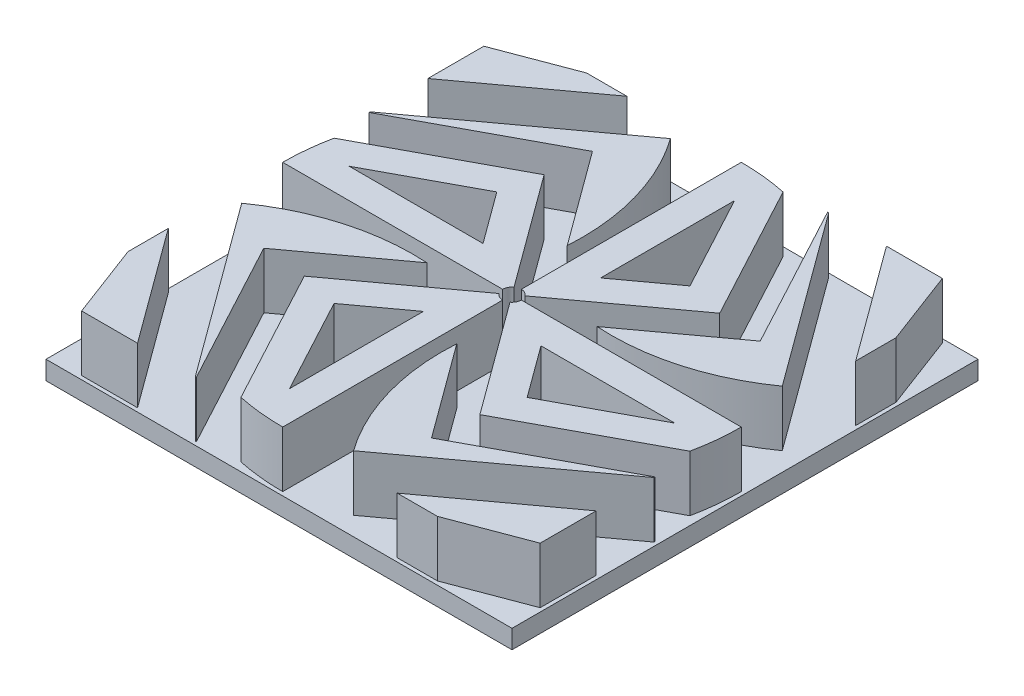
ISO-10303-21;
HEADER;
FILE_DESCRIPTION(('STEP AP214'),'2;1');
FILE_NAME('part.step','',(''),(''),'','','');
FILE_SCHEMA(('AUTOMOTIVE_DESIGN { 1 0 10303 214 1 1 1 1 }'));
ENDSEC;
DATA;
#1=APPLICATION_CONTEXT('core data for automotive mechanical design processes');
#2=APPLICATION_PROTOCOL_DEFINITION('international standard','automotive_design',2000,#1);
#3=PRODUCT_CONTEXT('',#1,'mechanical');
#4=PRODUCT('Part','Part','',(#3));
#5=PRODUCT_RELATED_PRODUCT_CATEGORY('part','',(#4));
#6=PRODUCT_DEFINITION_FORMATION('','',#4);
#7=PRODUCT_DEFINITION_CONTEXT('part definition',#1,'design');
#8=PRODUCT_DEFINITION('design','',#6,#7);
#9=PRODUCT_DEFINITION_SHAPE('','',#8);
#10=(LENGTH_UNIT() NAMED_UNIT(*) SI_UNIT(.MILLI.,.METRE.));
#11=(NAMED_UNIT(*) PLANE_ANGLE_UNIT() SI_UNIT($,.RADIAN.));
#12=(NAMED_UNIT(*) SI_UNIT($,.STERADIAN.) SOLID_ANGLE_UNIT());
#13=UNCERTAINTY_MEASURE_WITH_UNIT(LENGTH_MEASURE(1.E-05),#10,'distance_accuracy_value','');
#14=(GEOMETRIC_REPRESENTATION_CONTEXT(3) GLOBAL_UNCERTAINTY_ASSIGNED_CONTEXT((#13)) GLOBAL_UNIT_ASSIGNED_CONTEXT((#10,
#11,#12)) REPRESENTATION_CONTEXT('',''));
#15=CARTESIAN_POINT('',(0.,0.,0.));
#16=DIRECTION('',(0.,0.,1.));
#17=DIRECTION('',(1.,0.,0.));
#18=AXIS2_PLACEMENT_3D('',#15,#16,#17);
#19=CARTESIAN_POINT('',(0.,0.,0.));
#20=DIRECTION('',(0.,-1.,0.));
#21=DIRECTION('',(0.,0.,-1.));
#22=AXIS2_PLACEMENT_3D('',#19,#20,#21);
#23=PLANE('',#22);
#24=DIRECTION('',(0.935482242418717,0.,-0.353373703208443));
#25=VECTOR('',#24,1.);
#26=CARTESIAN_POINT('',(-51.0251602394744,0.,-135.07833459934));
#27=LINE('',#26,#25);
#28=CARTESIAN_POINT('',(-122.999999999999,0.,-107.890201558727));
#29=VERTEX_POINT('',#28);
#30=CARTESIAN_POINT('',(-82.9999999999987,0.,-123.000000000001));
#31=VERTEX_POINT('',#30);
#32=EDGE_CURVE('E758',#29,#31,#27,.T.);
#33=ORIENTED_EDGE('',*,*,#32,.T.);
#34=DIRECTION('',(1.,0.,0.));
#35=VECTOR('',#34,1.);
#36=CARTESIAN_POINT('',(1.28835661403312E-12,0.,-123.));
#37=LINE('',#36,#35);
#38=CARTESIAN_POINT('',(-61.3916872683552,0.,-123.000000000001));
#39=VERTEX_POINT('',#38);
#40=EDGE_CURVE('E726',#31,#39,#37,.T.);
#41=ORIENTED_EDGE('',*,*,#40,.T.);
#42=DIRECTION('',(-0.80683964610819,0.,0.590770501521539));
#43=VECTOR('',#42,1.);
#44=CARTESIAN_POINT('',(-80.0551182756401,0.,-109.334577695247));
#45=LINE('',#44,#43);
#46=CARTESIAN_POINT('',(-122.999999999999,0.,-77.8902015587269));
#47=VERTEX_POINT('',#46);
#48=EDGE_CURVE('E744',#39,#47,#45,.T.);
#49=ORIENTED_EDGE('',*,*,#48,.T.);
#50=DIRECTION('',(0.,0.,-1.));
#51=VECTOR('',#50,1.);
#52=CARTESIAN_POINT('',(-123.,0.,-1.28835661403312E-12));
#53=LINE('',#52,#51);
#54=EDGE_CURVE('E287',#47,#29,#53,.T.);
#55=ORIENTED_EDGE('',*,*,#54,.T.);
#56=EDGE_LOOP('',(#33,#41,#49,#55));
#57=FACE_BOUND('',#56,.T.);
#58=CARTESIAN_POINT('',(5.16080234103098E-13,0.,1.99926880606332E-13));
#59=DIRECTION('',(0.,1.,0.));
#60=DIRECTION('',(1.,0.,0.));
#61=AXIS2_PLACEMENT_3D('',#58,#59,#60);
#62=CIRCLE('',#61,5.00000000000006);
#63=CARTESIAN_POINT('',(-4.99999999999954,0.,1.18498042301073E-13));
#64=VERTEX_POINT('',#63);
#65=CARTESIAN_POINT('',(-2.95385250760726,0.,-4.03419823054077));
#66=VERTEX_POINT('',#65);
#67=EDGE_CURVE('E871',#64,#66,#62,.F.);
#68=ORIENTED_EDGE('',*,*,#67,.F.);
#69=DIRECTION('',(-1.,0.,0.));
#70=VECTOR('',#69,1.);
#71=CARTESIAN_POINT('',(0.,0.,1.70870262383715E-13));
#72=LINE('',#71,#70);
#73=CARTESIAN_POINT('',(-123.,0.,-1.1174863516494E-12));
#74=VERTEX_POINT('',#73);
#75=EDGE_CURVE('E868',#64,#74,#72,.T.);
#76=ORIENTED_EDGE('',*,*,#75,.T.);
#77=CARTESIAN_POINT('',(4.57966997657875E-13,0.,1.7087026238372E-13));
#78=DIRECTION('',(0.,1.,0.));
#79=DIRECTION('',(1.,0.,0.));
#80=AXIS2_PLACEMENT_3D('',#77,#78,#79);
#81=CIRCLE('',#80,123.);
#82=CARTESIAN_POINT('',(-120.432553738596,0.,-25.0000000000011));
#83=VERTEX_POINT('',#82);
#84=EDGE_CURVE('E831',#83,#74,#81,.T.);
#85=ORIENTED_EDGE('',*,*,#84,.F.);
#86=DIRECTION('',(-0.881206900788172,0.,0.47273078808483));
#87=VECTOR('',#86,1.);
#88=CARTESIAN_POINT('',(-37.3279332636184,0.,-69.5821664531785));
#89=LINE('',#88,#87);
#90=CARTESIAN_POINT('',(-47.1070690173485,0.,-64.3360675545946));
#91=VERTEX_POINT('',#90);
#92=EDGE_CURVE('E879',#91,#83,#89,.T.);
#93=ORIENTED_EDGE('',*,*,#92,.F.);
#94=DIRECTION('',(-0.590770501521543,0.,-0.806839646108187));
#95=VECTOR('',#94,1.);
#96=CARTESIAN_POINT('',(2.16594858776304E-13,0.,-1.58591430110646E-13));
#97=LINE('',#96,#95);
#98=EDGE_CURVE('E875',#66,#91,#97,.T.);
#99=ORIENTED_EDGE('',*,*,#98,.F.);
#100=EDGE_LOOP('',(#68,#76,#85,#93,#99));
#101=FACE_BOUND('',#100,.T.);
#102=DIRECTION('',(0.806839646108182,0.,-0.590770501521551));
#103=VECTOR('',#102,1.);
#104=CARTESIAN_POINT('',(-9.32003105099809,0.,-12.7287509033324));
#105=LINE('',#104,#103);
#106=CARTESIAN_POINT('',(-88.1625677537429,0.,44.9999999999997));
#107=VERTEX_POINT('',#106);
#108=CARTESIAN_POINT('',(-37.6301413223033,0.,8.00000000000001));
#109=VERTEX_POINT('',#108);
#110=EDGE_CURVE('E962',#107,#109,#105,.T.);
#111=ORIENTED_EDGE('',*,*,#110,.F.);
#112=DIRECTION('',(-0.472730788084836,0.,-0.881206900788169));
#113=VECTOR('',#112,1.);
#114=CARTESIAN_POINT('',(-87.2063044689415,0.,46.7825490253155));
#115=LINE('',#114,#113);
#116=CARTESIAN_POINT('',(-46.3188175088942,0.,123.));
#117=VERTEX_POINT('',#116);
#118=EDGE_CURVE('E968',#117,#107,#115,.T.);
#119=ORIENTED_EDGE('',*,*,#118,.F.);
#120=DIRECTION('',(1.,0.,0.));
#121=VECTOR('',#120,1.);
#122=CARTESIAN_POINT('',(0.,0.,123.));
#123=LINE('',#122,#121);
#124=CARTESIAN_POINT('',(-46.9051103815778,0.,123.));
#125=VERTEX_POINT('',#124);
#126=EDGE_CURVE('E992',#125,#117,#123,.T.);
#127=ORIENTED_EDGE('',*,*,#126,.F.);
#128=DIRECTION('',(0.590770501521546,0.,0.806839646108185));
#129=VECTOR('',#128,1.);
#130=CARTESIAN_POINT('',(-89.1635865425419,0.,65.2858557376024));
#131=LINE('',#130,#129);
#132=CARTESIAN_POINT('',(-115.,0.,30.));
#133=VERTEX_POINT('',#132);
#134=EDGE_CURVE('E988',#133,#125,#131,.T.);
#135=ORIENTED_EDGE('',*,*,#134,.F.);
#136=CARTESIAN_POINT('',(-45.3925528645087,0.,127.748674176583));
#137=DIRECTION('',(0.,1.,0.));
#138=DIRECTION('',(0.,0.,-1.));
#139=AXIS2_PLACEMENT_3D('',#136,#137,#138);
#140=CIRCLE('',#139,120.);
#141=EDGE_CURVE('E984',#109,#133,#140,.T.);
#142=ORIENTED_EDGE('',*,*,#141,.F.);
#143=EDGE_LOOP('',(#111,#119,#127,#135,#142));
#144=FACE_BOUND('',#143,.T.);
#145=DIRECTION('',(-0.935482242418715,0.,0.35337370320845));
#146=VECTOR('',#145,1.);
#147=CARTESIAN_POINT('',(51.0251602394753,0.,135.078334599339));
#148=LINE('',#147,#146);
#149=CARTESIAN_POINT('',(123.,0.,107.890201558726));
#150=VERTEX_POINT('',#149);
#151=CARTESIAN_POINT('',(82.9999999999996,0.,123.));
#152=VERTEX_POINT('',#151);
#153=EDGE_CURVE('E1132',#150,#152,#148,.T.);
#154=ORIENTED_EDGE('',*,*,#153,.T.);
#155=DIRECTION('',(-1.,0.,0.));
#156=VECTOR('',#155,1.);
#157=CARTESIAN_POINT('',(-4.29452204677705E-13,0.,123.));
#158=LINE('',#157,#156);
#159=CARTESIAN_POINT('',(61.3916872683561,0.,123.));
#160=VERTEX_POINT('',#159);
#161=EDGE_CURVE('E1100',#152,#160,#158,.T.);
#162=ORIENTED_EDGE('',*,*,#161,.T.);
#163=DIRECTION('',(0.806839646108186,0.,-0.590770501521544));
#164=VECTOR('',#163,1.);
#165=CARTESIAN_POINT('',(80.0551182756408,0.,109.334577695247));
#166=LINE('',#165,#164);
#167=CARTESIAN_POINT('',(123.,0.,77.8902015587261));
#168=VERTEX_POINT('',#167);
#169=EDGE_CURVE('E1116',#160,#168,#166,.T.);
#170=ORIENTED_EDGE('',*,*,#169,.T.);
#171=DIRECTION('',(0.,0.,1.));
#172=VECTOR('',#171,1.);
#173=CARTESIAN_POINT('',(123.,0.,4.29452204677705E-13));
#174=LINE('',#173,#172);
#175=EDGE_CURVE('E1136',#168,#150,#174,.T.);
#176=ORIENTED_EDGE('',*,*,#175,.T.);
#177=EDGE_LOOP('',(#154,#162,#170,#176));
#178=FACE_BOUND('',#177,.T.);
#179=CARTESIAN_POINT('',(-5.16080234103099E-13,0.,-1.99926880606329E-13));
#180=DIRECTION('',(0.,1.,0.));
#181=DIRECTION('',(-1.,0.,0.));
#182=AXIS2_PLACEMENT_3D('',#179,#180,#181);
#183=CIRCLE('',#182,5.00000000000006);
#184=CARTESIAN_POINT('',(4.99999999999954,0.,-1.53412855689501E-13));
#185=VERTEX_POINT('',#184);
#186=CARTESIAN_POINT('',(2.95385250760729,0.,4.03419823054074));
#187=VERTEX_POINT('',#186);
#188=EDGE_CURVE('E1257',#185,#187,#183,.F.);
#189=ORIENTED_EDGE('',*,*,#188,.F.);
#190=DIRECTION('',(1.,0.,0.));
#191=VECTOR('',#190,1.);
#192=CARTESIAN_POINT('',(0.,0.,-1.70870262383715E-13));
#193=LINE('',#192,#191);
#194=CARTESIAN_POINT('',(123.,0.,2.5858194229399E-13));
#195=VERTEX_POINT('',#194);
#196=EDGE_CURVE('E1254',#185,#195,#193,.T.);
#197=ORIENTED_EDGE('',*,*,#196,.T.);
#198=CARTESIAN_POINT('',(-4.57966997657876E-13,0.,-1.70870262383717E-13));
#199=DIRECTION('',(0.,1.,0.));
#200=DIRECTION('',(-1.,0.,0.));
#201=AXIS2_PLACEMENT_3D('',#198,#199,#200);
#202=CIRCLE('',#201,123.);
#203=CARTESIAN_POINT('',(120.432553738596,0.,25.0000000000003));
#204=VERTEX_POINT('',#203);
#205=EDGE_CURVE('E1217',#204,#195,#202,.T.);
#206=ORIENTED_EDGE('',*,*,#205,.F.);
#207=DIRECTION('',(0.881206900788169,0.,-0.472730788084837));
#208=VECTOR('',#207,1.);
#209=CARTESIAN_POINT('',(37.3279332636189,0.,69.5821664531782));
#210=LINE('',#209,#208);
#211=CARTESIAN_POINT('',(47.107069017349,0.,64.3360675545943));
#212=VERTEX_POINT('',#211);
#213=EDGE_CURVE('E1265',#212,#204,#210,.T.);
#214=ORIENTED_EDGE('',*,*,#213,.F.);
#215=DIRECTION('',(0.590770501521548,0.,0.806839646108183));
#216=VECTOR('',#215,1.);
#217=CARTESIAN_POINT('',(-2.16594858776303E-13,0.,1.58591430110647E-13));
#218=LINE('',#217,#216);
#219=EDGE_CURVE('E1261',#187,#212,#218,.T.);
#220=ORIENTED_EDGE('',*,*,#219,.F.);
#221=EDGE_LOOP('',(#189,#197,#206,#214,#220));
#222=FACE_BOUND('',#221,.T.);
#223=DIRECTION('',(-0.806839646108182,0.,0.590770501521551));
#224=VECTOR('',#223,1.);
#225=CARTESIAN_POINT('',(9.32003105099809,0.,12.7287509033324));
#226=LINE('',#225,#224);
#227=CARTESIAN_POINT('',(88.1625677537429,0.,-44.9999999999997));
#228=VERTEX_POINT('',#227);
#229=CARTESIAN_POINT('',(37.6301413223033,0.,-8.00000000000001));
#230=VERTEX_POINT('',#229);
#231=EDGE_CURVE('E1348',#228,#230,#226,.T.);
#232=ORIENTED_EDGE('',*,*,#231,.F.);
#233=DIRECTION('',(0.472730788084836,0.,0.881206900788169));
#234=VECTOR('',#233,1.);
#235=CARTESIAN_POINT('',(87.2063044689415,0.,-46.7825490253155));
#236=LINE('',#235,#234);
#237=CARTESIAN_POINT('',(46.3188175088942,0.,-123.));
#238=VERTEX_POINT('',#237);
#239=EDGE_CURVE('E1354',#238,#228,#236,.T.);
#240=ORIENTED_EDGE('',*,*,#239,.F.);
#241=DIRECTION('',(-1.,0.,0.));
#242=VECTOR('',#241,1.);
#243=CARTESIAN_POINT('',(0.,0.,-123.));
#244=LINE('',#243,#242);
#245=CARTESIAN_POINT('',(46.9051103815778,0.,-123.));
#246=VERTEX_POINT('',#245);
#247=EDGE_CURVE('E1378',#246,#238,#244,.T.);
#248=ORIENTED_EDGE('',*,*,#247,.F.);
#249=DIRECTION('',(-0.590770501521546,0.,-0.806839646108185));
#250=VECTOR('',#249,1.);
#251=CARTESIAN_POINT('',(89.1635865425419,0.,-65.2858557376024));
#252=LINE('',#251,#250);
#253=CARTESIAN_POINT('',(115.,0.,-30.));
#254=VERTEX_POINT('',#253);
#255=EDGE_CURVE('E1374',#254,#246,#252,.T.);
#256=ORIENTED_EDGE('',*,*,#255,.F.);
#257=CARTESIAN_POINT('',(45.3925528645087,0.,-127.748674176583));
#258=DIRECTION('',(0.,1.,0.));
#259=DIRECTION('',(0.,0.,1.));
#260=AXIS2_PLACEMENT_3D('',#257,#258,#259);
#261=CIRCLE('',#260,120.);
#262=EDGE_CURVE('E1370',#230,#254,#261,.T.);
#263=ORIENTED_EDGE('',*,*,#262,.F.);
#264=EDGE_LOOP('',(#232,#240,#248,#256,#263));
#265=FACE_BOUND('',#264,.T.);
#266=CARTESIAN_POINT('',(-1.99926880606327E-13,0.,5.160802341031E-13));
#267=DIRECTION('',(0.,1.,0.));
#268=DIRECTION('',(0.,0.,1.));
#269=AXIS2_PLACEMENT_3D('',#266,#267,#268);
#270=CIRCLE('',#269,5.00000000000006);
#271=CARTESIAN_POINT('',(-1.70870262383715E-13,0.,-4.99999999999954));
#272=VERTEX_POINT('',#271);
#273=CARTESIAN_POINT('',(4.03419823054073,0.,-2.9538525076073));
#274=VERTEX_POINT('',#273);
#275=EDGE_CURVE('E1450',#272,#274,#270,.F.);
#276=ORIENTED_EDGE('',*,*,#275,.F.);
#277=DIRECTION('',(0.,0.,-1.));
#278=VECTOR('',#277,1.);
#279=CARTESIAN_POINT('',(-1.70870262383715E-13,0.,0.));
#280=LINE('',#279,#278);
#281=CARTESIAN_POINT('',(-1.70870262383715E-13,0.,-123.));
#282=VERTEX_POINT('',#281);
#283=EDGE_CURVE('E1447',#272,#282,#280,.T.);
#284=ORIENTED_EDGE('',*,*,#283,.T.);
#285=CARTESIAN_POINT('',(-1.70870262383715E-13,0.,4.57966997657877E-13));
#286=DIRECTION('',(0.,1.,0.));
#287=DIRECTION('',(0.,0.,1.));
#288=AXIS2_PLACEMENT_3D('',#285,#286,#287);
#289=CIRCLE('',#288,123.);
#290=CARTESIAN_POINT('',(24.9999999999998,0.,-120.432553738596));
#291=VERTEX_POINT('',#290);
#292=EDGE_CURVE('E1410',#291,#282,#289,.T.);
#293=ORIENTED_EDGE('',*,*,#292,.F.);
#294=DIRECTION('',(-0.47273078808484,0.,-0.881206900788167));
#295=VECTOR('',#294,1.);
#296=CARTESIAN_POINT('',(69.5821664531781,0.,-37.3279332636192));
#297=LINE('',#296,#295);
#298=CARTESIAN_POINT('',(64.3360675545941,0.,-47.1070690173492));
#299=VERTEX_POINT('',#298);
#300=EDGE_CURVE('E1458',#299,#291,#297,.T.);
#301=ORIENTED_EDGE('',*,*,#300,.F.);
#302=DIRECTION('',(0.806839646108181,0.,-0.590770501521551));
#303=VECTOR('',#302,1.);
#304=CARTESIAN_POINT('',(1.58591430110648E-13,0.,2.16594858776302E-13));
#305=LINE('',#304,#303);
#306=EDGE_CURVE('E1454',#274,#299,#305,.T.);
#307=ORIENTED_EDGE('',*,*,#306,.F.);
#308=EDGE_LOOP('',(#276,#284,#293,#301,#307));
#309=FACE_BOUND('',#308,.T.);
#310=DIRECTION('',(0.,0.,1.));
#311=VECTOR('',#310,1.);
#312=CARTESIAN_POINT('',(-125.,0.,125.));
#313=LINE('',#312,#311);
#314=CARTESIAN_POINT('',(-125.,0.,-125.));
#315=VERTEX_POINT('',#314);
#316=CARTESIAN_POINT('',(-125.,0.,125.));
#317=VERTEX_POINT('',#316);
#318=EDGE_CURVE('E1486',#315,#317,#313,.T.);
#319=ORIENTED_EDGE('',*,*,#318,.T.);
#320=DIRECTION('',(1.,0.,0.));
#321=VECTOR('',#320,1.);
#322=CARTESIAN_POINT('',(-125.,0.,125.));
#323=LINE('',#322,#321);
#324=CARTESIAN_POINT('',(125.,0.,125.));
#325=VERTEX_POINT('',#324);
#326=EDGE_CURVE('E1517',#317,#325,#323,.T.);
#327=ORIENTED_EDGE('',*,*,#326,.T.);
#328=DIRECTION('',(0.,0.,-1.));
#329=VECTOR('',#328,1.);
#330=CARTESIAN_POINT('',(125.,0.,125.));
#331=LINE('',#330,#329);
#332=CARTESIAN_POINT('',(125.,0.,-125.));
#333=VERTEX_POINT('',#332);
#334=EDGE_CURVE('E1521',#325,#333,#331,.T.);
#335=ORIENTED_EDGE('',*,*,#334,.T.);
#336=DIRECTION('',(-1.,0.,0.));
#337=VECTOR('',#336,1.);
#338=CARTESIAN_POINT('',(-125.,0.,-125.));
#339=LINE('',#338,#337);
#340=EDGE_CURVE('E1502',#333,#315,#339,.T.);
#341=ORIENTED_EDGE('',*,*,#340,.T.);
#342=EDGE_LOOP('',(#319,#327,#335,#341));
#343=FACE_BOUND('',#342,.T.);
#344=DIRECTION('',(0.353373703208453,0.,0.935482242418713));
#345=VECTOR('',#344,1.);
#346=CARTESIAN_POINT('',(135.078334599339,0.,-51.0251602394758));
#347=LINE('',#346,#345);
#348=CARTESIAN_POINT('',(107.890201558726,0.,-123.));
#349=VERTEX_POINT('',#348);
#350=CARTESIAN_POINT('',(123.,0.,-83.));
#351=VERTEX_POINT('',#350);
#352=EDGE_CURVE('E1325',#349,#351,#347,.T.);
#353=ORIENTED_EDGE('',*,*,#352,.T.);
#354=DIRECTION('',(0.,0.,1.));
#355=VECTOR('',#354,1.);
#356=CARTESIAN_POINT('',(123.,0.,0.));
#357=LINE('',#356,#355);
#358=CARTESIAN_POINT('',(123.,0.,-61.3916872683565));
#359=VERTEX_POINT('',#358);
#360=EDGE_CURVE('E1293',#351,#359,#357,.T.);
#361=ORIENTED_EDGE('',*,*,#360,.T.);
#362=DIRECTION('',(-0.590770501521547,0.,-0.806839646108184));
#363=VECTOR('',#362,1.);
#364=CARTESIAN_POINT('',(109.334577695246,0.,-80.0551182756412));
#365=LINE('',#364,#363);
#366=CARTESIAN_POINT('',(77.8902015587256,0.,-123.));
#367=VERTEX_POINT('',#366);
#368=EDGE_CURVE('E1309',#359,#367,#365,.T.);
#369=ORIENTED_EDGE('',*,*,#368,.T.);
#370=DIRECTION('',(1.,0.,0.));
#371=VECTOR('',#370,1.);
#372=CARTESIAN_POINT('',(0.,0.,-123.));
#373=LINE('',#372,#371);
#374=EDGE_CURVE('E1329',#367,#349,#373,.T.);
#375=ORIENTED_EDGE('',*,*,#374,.T.);
#376=EDGE_LOOP('',(#353,#361,#369,#375));
#377=FACE_BOUND('',#376,.T.);
#378=DIRECTION('',(-0.590770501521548,0.,-0.806839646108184));
#379=VECTOR('',#378,1.);
#380=CARTESIAN_POINT('',(-12.7287509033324,0.,9.32003105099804));
#381=LINE('',#380,#379);
#382=CARTESIAN_POINT('',(44.9999999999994,0.,88.1625677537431));
#383=VERTEX_POINT('',#382);
#384=CARTESIAN_POINT('',(7.99999999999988,0.,37.6301413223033));
#385=VERTEX_POINT('',#384);
#386=EDGE_CURVE('E1155',#383,#385,#381,.T.);
#387=ORIENTED_EDGE('',*,*,#386,.F.);
#388=DIRECTION('',(-0.881206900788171,0.,0.472730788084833));
#389=VECTOR('',#388,1.);
#390=CARTESIAN_POINT('',(46.7825490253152,0.,87.2063044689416));
#391=LINE('',#390,#389);
#392=CARTESIAN_POINT('',(123.,0.,46.3188175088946));
#393=VERTEX_POINT('',#392);
#394=EDGE_CURVE('E1161',#393,#383,#391,.T.);
#395=ORIENTED_EDGE('',*,*,#394,.F.);
#396=DIRECTION('',(0.,0.,-1.));
#397=VECTOR('',#396,1.);
#398=CARTESIAN_POINT('',(123.,0.,4.29452204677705E-13));
#399=LINE('',#398,#397);
#400=CARTESIAN_POINT('',(123.,0.,46.9051103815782));
#401=VERTEX_POINT('',#400);
#402=EDGE_CURVE('E1185',#401,#393,#399,.T.);
#403=ORIENTED_EDGE('',*,*,#402,.F.);
#404=DIRECTION('',(0.806839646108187,0.,-0.590770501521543));
#405=VECTOR('',#404,1.);
#406=CARTESIAN_POINT('',(65.2858557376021,0.,89.1635865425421));
#407=LINE('',#406,#405);
#408=CARTESIAN_POINT('',(29.9999999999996,0.,115.));
#409=VERTEX_POINT('',#408);
#410=EDGE_CURVE('E1181',#409,#401,#407,.T.);
#411=ORIENTED_EDGE('',*,*,#410,.F.);
#412=CARTESIAN_POINT('',(127.748674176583,0.,45.3925528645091));
#413=DIRECTION('',(0.,1.,0.));
#414=DIRECTION('',(-1.,0.,0.));
#415=AXIS2_PLACEMENT_3D('',#412,#413,#414);
#416=CIRCLE('',#415,120.);
#417=EDGE_CURVE('E1177',#385,#409,#416,.T.);
#418=ORIENTED_EDGE('',*,*,#417,.F.);
#419=EDGE_LOOP('',(#387,#395,#403,#411,#418));
#420=FACE_BOUND('',#419,.T.);
#421=CARTESIAN_POINT('',(1.99926880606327E-13,0.,-5.160802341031E-13));
#422=DIRECTION('',(0.,1.,0.));
#423=DIRECTION('',(0.,0.,-1.));
#424=AXIS2_PLACEMENT_3D('',#421,#422,#423);
#425=CIRCLE('',#424,5.00000000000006);
#426=CARTESIAN_POINT('',(1.70870262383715E-13,0.,4.99999999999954));
#427=VERTEX_POINT('',#426);
#428=CARTESIAN_POINT('',(-4.03419823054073,0.,2.9538525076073));
#429=VERTEX_POINT('',#428);
#430=EDGE_CURVE('E1064',#427,#429,#425,.F.);
#431=ORIENTED_EDGE('',*,*,#430,.F.);
#432=DIRECTION('',(0.,0.,1.));
#433=VECTOR('',#432,1.);
#434=CARTESIAN_POINT('',(1.70870262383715E-13,0.,0.));
#435=LINE('',#434,#433);
#436=CARTESIAN_POINT('',(1.70870262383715E-13,0.,123.));
#437=VERTEX_POINT('',#436);
#438=EDGE_CURVE('E1061',#427,#437,#435,.T.);
#439=ORIENTED_EDGE('',*,*,#438,.T.);
#440=CARTESIAN_POINT('',(1.70870262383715E-13,0.,-4.57966997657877E-13));
#441=DIRECTION('',(0.,1.,0.));
#442=DIRECTION('',(0.,0.,-1.));
#443=AXIS2_PLACEMENT_3D('',#440,#441,#442);
#444=CIRCLE('',#443,123.);
#445=CARTESIAN_POINT('',(-24.9999999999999,0.,120.432553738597));
#446=VERTEX_POINT('',#445);
#447=EDGE_CURVE('E1024',#446,#437,#444,.T.);
#448=ORIENTED_EDGE('',*,*,#447,.F.);
#449=DIRECTION('',(0.47273078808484,0.,0.881206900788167));
#450=VECTOR('',#449,1.);
#451=CARTESIAN_POINT('',(-69.5821664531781,0.,37.3279332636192));
#452=LINE('',#451,#450);
#453=CARTESIAN_POINT('',(-64.3360675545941,0.,47.1070690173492));
#454=VERTEX_POINT('',#453);
#455=EDGE_CURVE('E1072',#454,#446,#452,.T.);
#456=ORIENTED_EDGE('',*,*,#455,.F.);
#457=DIRECTION('',(-0.806839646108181,0.,0.590770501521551));
#458=VECTOR('',#457,1.);
#459=CARTESIAN_POINT('',(-1.58591430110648E-13,0.,-2.16594858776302E-13));
#460=LINE('',#459,#458);
#461=EDGE_CURVE('E1068',#429,#454,#460,.T.);
#462=ORIENTED_EDGE('',*,*,#461,.F.);
#463=EDGE_LOOP('',(#431,#439,#448,#456,#462));
#464=FACE_BOUND('',#463,.T.);
#465=DIRECTION('',(-0.353373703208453,0.,-0.935482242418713));
#466=VECTOR('',#465,1.);
#467=CARTESIAN_POINT('',(-135.078334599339,0.,51.0251602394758));
#468=LINE('',#467,#466);
#469=CARTESIAN_POINT('',(-107.890201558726,0.,123.));
#470=VERTEX_POINT('',#469);
#471=CARTESIAN_POINT('',(-123.,0.,83.));
#472=VERTEX_POINT('',#471);
#473=EDGE_CURVE('E939',#470,#472,#468,.T.);
#474=ORIENTED_EDGE('',*,*,#473,.T.);
#475=DIRECTION('',(0.,0.,-1.));
#476=VECTOR('',#475,1.);
#477=CARTESIAN_POINT('',(-123.,0.,0.));
#478=LINE('',#477,#476);
#479=CARTESIAN_POINT('',(-123.,0.,61.3916872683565));
#480=VERTEX_POINT('',#479);
#481=EDGE_CURVE('E907',#472,#480,#478,.T.);
#482=ORIENTED_EDGE('',*,*,#481,.T.);
#483=DIRECTION('',(0.590770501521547,0.,0.806839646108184));
#484=VECTOR('',#483,1.);
#485=CARTESIAN_POINT('',(-109.334577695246,0.,80.0551182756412));
#486=LINE('',#485,#484);
#487=CARTESIAN_POINT('',(-77.8902015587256,0.,123.));
#488=VERTEX_POINT('',#487);
#489=EDGE_CURVE('E923',#480,#488,#486,.T.);
#490=ORIENTED_EDGE('',*,*,#489,.T.);
#491=DIRECTION('',(-1.,0.,0.));
#492=VECTOR('',#491,1.);
#493=CARTESIAN_POINT('',(0.,0.,123.));
#494=LINE('',#493,#492);
#495=EDGE_CURVE('E943',#488,#470,#494,.T.);
#496=ORIENTED_EDGE('',*,*,#495,.T.);
#497=EDGE_LOOP('',(#474,#482,#490,#496));
#498=FACE_BOUND('',#497,.T.);
#499=DIRECTION('',(0.590770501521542,0.,0.806839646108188));
#500=VECTOR('',#499,1.);
#501=CARTESIAN_POINT('',(12.7287509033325,0.,-9.32003105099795));
#502=LINE('',#501,#500);
#503=CARTESIAN_POINT('',(-44.9999999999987,0.,-88.1625677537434));
#504=VERTEX_POINT('',#503);
#505=CARTESIAN_POINT('',(-7.99999999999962,0.,-37.6301413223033));
#506=VERTEX_POINT('',#505);
#507=EDGE_CURVE('E732',#504,#506,#502,.T.);
#508=ORIENTED_EDGE('',*,*,#507,.F.);
#509=DIRECTION('',(0.881206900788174,0.,-0.472730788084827));
#510=VECTOR('',#509,1.);
#511=CARTESIAN_POINT('',(-46.7825490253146,0.,-87.206304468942));
#512=LINE('',#511,#510);
#513=CARTESIAN_POINT('',(-123.,0.,-46.3188175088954));
#514=VERTEX_POINT('',#513);
#515=EDGE_CURVE('E778',#514,#504,#512,.T.);
#516=ORIENTED_EDGE('',*,*,#515,.F.);
#517=DIRECTION('',(0.,0.,1.));
#518=VECTOR('',#517,1.);
#519=CARTESIAN_POINT('',(-123.,0.,-1.28835661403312E-12));
#520=LINE('',#519,#518);
#521=CARTESIAN_POINT('',(-123.,0.,-46.905110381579));
#522=VERTEX_POINT('',#521);
#523=EDGE_CURVE('E800',#522,#514,#520,.T.);
#524=ORIENTED_EDGE('',*,*,#523,.F.);
#525=DIRECTION('',(-0.806839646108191,0.,0.590770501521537));
#526=VECTOR('',#525,1.);
#527=CARTESIAN_POINT('',(-65.2858557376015,0.,-89.1635865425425));
#528=LINE('',#527,#526);
#529=CARTESIAN_POINT('',(-29.9999999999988,0.,-115.));
#530=VERTEX_POINT('',#529);
#531=EDGE_CURVE('E796',#530,#522,#528,.T.);
#532=ORIENTED_EDGE('',*,*,#531,.F.);
#533=CARTESIAN_POINT('',(-127.748674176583,0.,-45.39255286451));
#534=DIRECTION('',(0.,1.,0.));
#535=DIRECTION('',(1.,0.,0.));
#536=AXIS2_PLACEMENT_3D('',#533,#534,#535);
#537=CIRCLE('',#536,120.);
#538=EDGE_CURVE('E295',#506,#530,#537,.T.);
#539=ORIENTED_EDGE('',*,*,#538,.F.);
#540=EDGE_LOOP('',(#508,#516,#524,#532,#539));
#541=FACE_BOUND('',#540,.T.);
#542=ADVANCED_FACE('F269',(#57,#101,#144,#178,#222,#265,#309,#343,#377,#420,#464,#498,#541),#23,.F.);
#543=CARTESIAN_POINT('',(-125.,-10.,125.));
#544=DIRECTION('',(-1.,0.,0.));
#545=DIRECTION('',(0.,0.,1.));
#546=AXIS2_PLACEMENT_3D('',#543,#544,#545);
#547=PLANE('',#546);
#548=ORIENTED_EDGE('',*,*,#318,.F.);
#549=DIRECTION('',(0.,1.,0.));
#550=VECTOR('',#549,1.);
#551=CARTESIAN_POINT('',(-125.,-10.,-125.));
#552=LINE('',#551,#550);
#553=CARTESIAN_POINT('',(-125.,-10.,-125.));
#554=VERTEX_POINT('',#553);
#555=EDGE_CURVE('E12',#554,#315,#552,.T.);
#556=ORIENTED_EDGE('',*,*,#555,.F.);
#557=DIRECTION('',(0.,0.,1.));
#558=VECTOR('',#557,1.);
#559=CARTESIAN_POINT('',(-125.,-10.,125.));
#560=LINE('',#559,#558);
#561=CARTESIAN_POINT('',(-125.,-10.,125.));
#562=VERTEX_POINT('',#561);
#563=EDGE_CURVE('E1497',#554,#562,#560,.T.);
#564=ORIENTED_EDGE('',*,*,#563,.T.);
#565=DIRECTION('',(0.,1.,0.));
#566=VECTOR('',#565,1.);
#567=CARTESIAN_POINT('',(-125.,-10.,125.));
#568=LINE('',#567,#566);
#569=EDGE_CURVE('E273',#562,#317,#568,.T.);
#570=ORIENTED_EDGE('',*,*,#569,.T.);
#571=EDGE_LOOP('',(#548,#556,#564,#570));
#572=FACE_BOUND('',#571,.T.);
#573=ADVANCED_FACE('F271',(#572),#547,.T.);
#574=CARTESIAN_POINT('',(-125.,-10.,-125.));
#575=DIRECTION('',(0.,0.,-1.));
#576=DIRECTION('',(-1.,0.,0.));
#577=AXIS2_PLACEMENT_3D('',#574,#575,#576);
#578=PLANE('',#577);
#579=ORIENTED_EDGE('',*,*,#340,.F.);
#580=DIRECTION('',(0.,1.,0.));
#581=VECTOR('',#580,1.);
#582=CARTESIAN_POINT('',(125.,-10.,-125.));
#583=LINE('',#582,#581);
#584=CARTESIAN_POINT('',(125.,-10.,-125.));
#585=VERTEX_POINT('',#584);
#586=EDGE_CURVE('E279',#585,#333,#583,.T.);
#587=ORIENTED_EDGE('',*,*,#586,.F.);
#588=DIRECTION('',(-1.,0.,0.));
#589=VECTOR('',#588,1.);
#590=CARTESIAN_POINT('',(-125.,-10.,-125.));
#591=LINE('',#590,#589);
#592=EDGE_CURVE('E1510',#585,#554,#591,.T.);
#593=ORIENTED_EDGE('',*,*,#592,.T.);
#594=ORIENTED_EDGE('',*,*,#555,.T.);
#595=EDGE_LOOP('',(#579,#587,#593,#594));
#596=FACE_BOUND('',#595,.T.);
#597=ADVANCED_FACE('F1544',(#596),#578,.T.);
#598=CARTESIAN_POINT('',(125.,-10.,125.));
#599=DIRECTION('',(1.,0.,0.));
#600=DIRECTION('',(0.,0.,-1.));
#601=AXIS2_PLACEMENT_3D('',#598,#599,#600);
#602=PLANE('',#601);
#603=ORIENTED_EDGE('',*,*,#334,.F.);
#604=DIRECTION('',(0.,1.,0.));
#605=VECTOR('',#604,1.);
#606=CARTESIAN_POINT('',(125.,-10.,125.));
#607=LINE('',#606,#605);
#608=CARTESIAN_POINT('',(125.,-10.,125.));
#609=VERTEX_POINT('',#608);
#610=EDGE_CURVE('E1529',#609,#325,#607,.T.);
#611=ORIENTED_EDGE('',*,*,#610,.F.);
#612=DIRECTION('',(0.,0.,-1.));
#613=VECTOR('',#612,1.);
#614=CARTESIAN_POINT('',(125.,-10.,125.));
#615=LINE('',#614,#613);
#616=EDGE_CURVE('E1506',#609,#585,#615,.T.);
#617=ORIENTED_EDGE('',*,*,#616,.T.);
#618=ORIENTED_EDGE('',*,*,#586,.T.);
#619=EDGE_LOOP('',(#603,#611,#617,#618));
#620=FACE_BOUND('',#619,.T.);
#621=ADVANCED_FACE('F1550',(#620),#602,.T.);
#622=CARTESIAN_POINT('',(-125.,-10.,125.));
#623=DIRECTION('',(0.,0.,1.));
#624=DIRECTION('',(1.,0.,0.));
#625=AXIS2_PLACEMENT_3D('',#622,#623,#624);
#626=PLANE('',#625);
#627=ORIENTED_EDGE('',*,*,#326,.F.);
#628=ORIENTED_EDGE('',*,*,#569,.F.);
#629=DIRECTION('',(1.,0.,0.));
#630=VECTOR('',#629,1.);
#631=CARTESIAN_POINT('',(-125.,-10.,125.));
#632=LINE('',#631,#630);
#633=EDGE_CURVE('E1501',#562,#609,#632,.T.);
#634=ORIENTED_EDGE('',*,*,#633,.T.);
#635=ORIENTED_EDGE('',*,*,#610,.T.);
#636=EDGE_LOOP('',(#627,#628,#634,#635));
#637=FACE_BOUND('',#636,.T.);
#638=ADVANCED_FACE('F1539',(#637),#626,.T.);
#639=CARTESIAN_POINT('',(0.,-10.,0.));
#640=DIRECTION('',(0.,-1.,0.));
#641=DIRECTION('',(0.,0.,-1.));
#642=AXIS2_PLACEMENT_3D('',#639,#640,#641);
#643=PLANE('',#642);
#644=ORIENTED_EDGE('',*,*,#563,.F.);
#645=ORIENTED_EDGE('',*,*,#592,.F.);
#646=ORIENTED_EDGE('',*,*,#616,.F.);
#647=ORIENTED_EDGE('',*,*,#633,.F.);
#648=EDGE_LOOP('',(#644,#645,#646,#647));
#649=FACE_BOUND('',#648,.T.);
#650=ADVANCED_FACE('F1547',(#649),#643,.T.);
#651=CARTESIAN_POINT('',(-1.70870262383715E-13,30.,0.));
#652=DIRECTION('',(-1.,0.,0.));
#653=DIRECTION('',(0.,0.,1.));
#654=AXIS2_PLACEMENT_3D('',#651,#652,#653);
#655=PLANE('',#654);
#656=ORIENTED_EDGE('',*,*,#283,.F.);
#657=DIRECTION('',(0.,-1.,0.));
#658=VECTOR('',#657,1.);
#659=CARTESIAN_POINT('',(-1.70870262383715E-13,30.,-4.99999999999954));
#660=LINE('',#659,#658);
#661=CARTESIAN_POINT('',(-1.70870262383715E-13,30.,-4.99999999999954));
#662=VERTEX_POINT('',#661);
#663=EDGE_CURVE('E1482',#662,#272,#660,.T.);
#664=ORIENTED_EDGE('',*,*,#663,.F.);
#665=DIRECTION('',(0.,0.,-1.));
#666=VECTOR('',#665,1.);
#667=CARTESIAN_POINT('',(-1.70870262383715E-13,30.,0.));
#668=LINE('',#667,#666);
#669=CARTESIAN_POINT('',(-1.70870262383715E-13,30.,-123.));
#670=VERTEX_POINT('',#669);
#671=EDGE_CURVE('E1416',#662,#670,#668,.T.);
#672=ORIENTED_EDGE('',*,*,#671,.T.);
#673=DIRECTION('',(0.,-1.,0.));
#674=VECTOR('',#673,1.);
#675=CARTESIAN_POINT('',(-1.70870262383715E-13,30.,-123.));
#676=LINE('',#675,#674);
#677=EDGE_CURVE('E1465',#670,#282,#676,.T.);
#678=ORIENTED_EDGE('',*,*,#677,.T.);
#679=EDGE_LOOP('',(#656,#664,#672,#678));
#680=FACE_BOUND('',#679,.T.);
#681=ADVANCED_FACE('F1765',(#680),#655,.T.);
#682=CARTESIAN_POINT('',(-1.99926880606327E-13,30.,5.160802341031E-13));
#683=DIRECTION('',(0.,-1.,0.));
#684=DIRECTION('',(0.,0.,-1.));
#685=AXIS2_PLACEMENT_3D('',#682,#683,#684);
#686=CYLINDRICAL_SURFACE('',#685,5.00000000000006);
#687=ORIENTED_EDGE('',*,*,#275,.T.);
#688=DIRECTION('',(0.,-1.,0.));
#689=VECTOR('',#688,1.);
#690=CARTESIAN_POINT('',(4.03419823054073,30.,-2.9538525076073));
#691=LINE('',#690,#689);
#692=CARTESIAN_POINT('',(4.03419823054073,30.,-2.9538525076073));
#693=VERTEX_POINT('',#692);
#694=EDGE_CURVE('E1478',#693,#274,#691,.T.);
#695=ORIENTED_EDGE('',*,*,#694,.F.);
#696=CARTESIAN_POINT('',(-1.99926880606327E-13,30.,5.160802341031E-13));
#697=DIRECTION('',(0.,1.,0.));
#698=DIRECTION('',(0.,0.,1.));
#699=AXIS2_PLACEMENT_3D('',#696,#697,#698);
#700=CIRCLE('',#699,5.00000000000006);
#701=EDGE_CURVE('E1420',#662,#693,#700,.F.);
#702=ORIENTED_EDGE('',*,*,#701,.F.);
#703=ORIENTED_EDGE('',*,*,#663,.T.);
#704=EDGE_LOOP('',(#687,#695,#702,#703));
#705=FACE_BOUND('',#704,.T.);
#706=ADVANCED_FACE('F1761',(#705),#686,.F.);
#707=CARTESIAN_POINT('',(1.58591430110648E-13,30.,2.16594858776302E-13));
#708=DIRECTION('',(-0.590770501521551,0.,-0.806839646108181));
#709=DIRECTION('',(-0.806839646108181,0.,0.590770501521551));
#710=AXIS2_PLACEMENT_3D('',#707,#708,#709);
#711=PLANE('',#710);
#712=ORIENTED_EDGE('',*,*,#306,.T.);
#713=DIRECTION('',(0.,-1.,0.));
#714=VECTOR('',#713,1.);
#715=CARTESIAN_POINT('',(64.3360675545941,30.,-47.1070690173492));
#716=LINE('',#715,#714);
#717=CARTESIAN_POINT('',(64.3360675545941,30.,-47.1070690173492));
#718=VERTEX_POINT('',#717);
#719=EDGE_CURVE('E1474',#718,#299,#716,.T.);
#720=ORIENTED_EDGE('',*,*,#719,.F.);
#721=DIRECTION('',(0.806839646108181,0.,-0.590770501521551));
#722=VECTOR('',#721,1.);
#723=CARTESIAN_POINT('',(1.58591430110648E-13,30.,2.16594858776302E-13));
#724=LINE('',#723,#722);
#725=EDGE_CURVE('E1424',#693,#718,#724,.T.);
#726=ORIENTED_EDGE('',*,*,#725,.F.);
#727=ORIENTED_EDGE('',*,*,#694,.T.);
#728=EDGE_LOOP('',(#712,#720,#726,#727));
#729=FACE_BOUND('',#728,.T.);
#730=ADVANCED_FACE('F1757',(#729),#711,.F.);
#731=CARTESIAN_POINT('',(69.5821664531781,30.,-37.3279332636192));
#732=DIRECTION('',(-0.881206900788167,0.,0.47273078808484));
#733=DIRECTION('',(0.47273078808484,0.,0.881206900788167));
#734=AXIS2_PLACEMENT_3D('',#731,#732,#733);
#735=PLANE('',#734);
#736=ORIENTED_EDGE('',*,*,#300,.T.);
#737=DIRECTION('',(0.,-1.,0.));
#738=VECTOR('',#737,1.);
#739=CARTESIAN_POINT('',(24.9999999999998,30.,-120.432553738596));
#740=LINE('',#739,#738);
#741=CARTESIAN_POINT('',(24.9999999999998,30.,-120.432553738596));
#742=VERTEX_POINT('',#741);
#743=EDGE_CURVE('E1469',#742,#291,#740,.T.);
#744=ORIENTED_EDGE('',*,*,#743,.F.);
#745=DIRECTION('',(-0.47273078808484,0.,-0.881206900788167));
#746=VECTOR('',#745,1.);
#747=CARTESIAN_POINT('',(69.5821664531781,30.,-37.3279332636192));
#748=LINE('',#747,#746);
#749=EDGE_CURVE('E1428',#718,#742,#748,.T.);
#750=ORIENTED_EDGE('',*,*,#749,.F.);
#751=ORIENTED_EDGE('',*,*,#719,.T.);
#752=EDGE_LOOP('',(#736,#744,#750,#751));
#753=FACE_BOUND('',#752,.T.);
#754=ADVANCED_FACE('F1753',(#753),#735,.F.);
#755=CARTESIAN_POINT('',(-9.45232802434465,30.,-12.9094343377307));
#756=DIRECTION('',(0.590770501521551,0.,0.806839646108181));
#757=DIRECTION('',(0.806839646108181,0.,-0.590770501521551));
#758=AXIS2_PLACEMENT_3D('',#755,#756,#757);
#759=PLANE('',#758);
#760=DIRECTION('',(-0.806839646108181,0.,0.590770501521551));
#761=VECTOR('',#760,1.);
#762=CARTESIAN_POINT('',(-9.45232802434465,0.,-12.9094343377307));
#763=LINE('',#762,#761);
#764=CARTESIAN_POINT('',(43.6617394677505,0.,-51.7997199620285));
#765=VERTEX_POINT('',#764);
#766=CARTESIAN_POINT('',(15.9999999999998,0.,-31.5457081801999));
#767=VERTEX_POINT('',#766);
#768=EDGE_CURVE('E1404',#765,#767,#763,.T.);
#769=ORIENTED_EDGE('',*,*,#768,.T.);
#770=DIRECTION('',(0.,-1.,0.));
#771=VECTOR('',#770,1.);
#772=CARTESIAN_POINT('',(15.9999999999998,30.,-31.5457081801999));
#773=LINE('',#772,#771);
#774=CARTESIAN_POINT('',(15.9999999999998,30.,-31.5457081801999));
#775=VERTEX_POINT('',#774);
#776=EDGE_CURVE('E1470',#775,#767,#773,.T.);
#777=ORIENTED_EDGE('',*,*,#776,.F.);
#778=DIRECTION('',(-0.806839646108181,0.,0.590770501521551));
#779=VECTOR('',#778,1.);
#780=CARTESIAN_POINT('',(-9.45232802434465,30.,-12.9094343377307));
#781=LINE('',#780,#779);
#782=CARTESIAN_POINT('',(43.6617394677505,30.,-51.7997199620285));
#783=VERTEX_POINT('',#782);
#784=EDGE_CURVE('E1405',#783,#775,#781,.T.);
#785=ORIENTED_EDGE('',*,*,#784,.F.);
#786=DIRECTION('',(0.,-1.,0.));
#787=VECTOR('',#786,1.);
#788=CARTESIAN_POINT('',(43.6617394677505,30.,-51.7997199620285));
#789=LINE('',#788,#787);
#790=EDGE_CURVE('E1435',#783,#765,#789,.T.);
#791=ORIENTED_EDGE('',*,*,#790,.T.);
#792=EDGE_LOOP('',(#769,#777,#785,#791));
#793=FACE_BOUND('',#792,.T.);
#794=ADVANCED_FACE('F1756',(#793),#759,.F.);
#795=CARTESIAN_POINT('',(15.9999999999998,30.,0.));
#796=DIRECTION('',(-1.,0.,0.));
#797=DIRECTION('',(0.,0.,1.));
#798=AXIS2_PLACEMENT_3D('',#795,#796,#797);
#799=PLANE('',#798);
#800=DIRECTION('',(0.,0.,-1.));
#801=VECTOR('',#800,1.);
#802=CARTESIAN_POINT('',(15.9999999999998,0.,0.));
#803=LINE('',#802,#801);
#804=CARTESIAN_POINT('',(15.9999999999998,0.,-103.36335051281));
#805=VERTEX_POINT('',#804);
#806=EDGE_CURVE('E1439',#767,#805,#803,.T.);
#807=ORIENTED_EDGE('',*,*,#806,.T.);
#808=DIRECTION('',(0.,-1.,0.));
#809=VECTOR('',#808,1.);
#810=CARTESIAN_POINT('',(15.9999999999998,30.,-103.36335051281));
#811=LINE('',#810,#809);
#812=CARTESIAN_POINT('',(15.9999999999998,30.,-103.36335051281));
#813=VERTEX_POINT('',#812);
#814=EDGE_CURVE('E1490',#813,#805,#811,.T.);
#815=ORIENTED_EDGE('',*,*,#814,.F.);
#816=DIRECTION('',(0.,0.,-1.));
#817=VECTOR('',#816,1.);
#818=CARTESIAN_POINT('',(15.9999999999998,30.,0.));
#819=LINE('',#818,#817);
#820=EDGE_CURVE('E1409',#775,#813,#819,.T.);
#821=ORIENTED_EDGE('',*,*,#820,.F.);
#822=ORIENTED_EDGE('',*,*,#776,.T.);
#823=EDGE_LOOP('',(#807,#815,#821,#822));
#824=FACE_BOUND('',#823,.T.);
#825=ADVANCED_FACE('F1772',(#824),#799,.F.);
#826=CARTESIAN_POINT('',(55.4828560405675,30.,-29.7642406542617));
#827=DIRECTION('',(0.881206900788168,0.,-0.472730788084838));
#828=DIRECTION('',(-0.472730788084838,0.,-0.881206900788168));
#829=AXIS2_PLACEMENT_3D('',#826,#827,#828);
#830=PLANE('',#829);
#831=DIRECTION('',(0.472730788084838,0.,0.881206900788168));
#832=VECTOR('',#831,1.);
#833=CARTESIAN_POINT('',(55.4828560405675,0.,-29.7642406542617));
#834=LINE('',#833,#832);
#835=EDGE_CURVE('E1443',#805,#765,#834,.T.);
#836=ORIENTED_EDGE('',*,*,#835,.T.);
#837=ORIENTED_EDGE('',*,*,#790,.F.);
#838=DIRECTION('',(0.472730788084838,0.,0.881206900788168));
#839=VECTOR('',#838,1.);
#840=CARTESIAN_POINT('',(55.4828560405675,30.,-29.7642406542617));
#841=LINE('',#840,#839);
#842=EDGE_CURVE('E1413',#813,#783,#841,.T.);
#843=ORIENTED_EDGE('',*,*,#842,.F.);
#844=ORIENTED_EDGE('',*,*,#814,.T.);
#845=EDGE_LOOP('',(#836,#837,#843,#844));
#846=FACE_BOUND('',#845,.T.);
#847=ADVANCED_FACE('F1751',(#846),#830,.F.);
#848=CARTESIAN_POINT('',(-1.70870262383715E-13,30.,4.57966997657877E-13));
#849=DIRECTION('',(0.,-1.,0.));
#850=DIRECTION('',(0.,0.,-1.));
#851=AXIS2_PLACEMENT_3D('',#848,#849,#850);
#852=CYLINDRICAL_SURFACE('',#851,123.);
#853=ORIENTED_EDGE('',*,*,#292,.T.);
#854=ORIENTED_EDGE('',*,*,#677,.F.);
#855=CARTESIAN_POINT('',(-1.70870262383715E-13,30.,4.57966997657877E-13));
#856=DIRECTION('',(0.,1.,0.));
#857=DIRECTION('',(0.,0.,1.));
#858=AXIS2_PLACEMENT_3D('',#855,#856,#857);
#859=CIRCLE('',#858,123.);
#860=EDGE_CURVE('E1432',#742,#670,#859,.T.);
#861=ORIENTED_EDGE('',*,*,#860,.F.);
#862=ORIENTED_EDGE('',*,*,#743,.T.);
#863=EDGE_LOOP('',(#853,#854,#861,#862));
#864=FACE_BOUND('',#863,.T.);
#865=ADVANCED_FACE('F1599',(#864),#852,.T.);
#866=CARTESIAN_POINT('',(0.,30.,0.));
#867=DIRECTION('',(0.,1.,0.));
#868=DIRECTION('',(0.,0.,1.));
#869=AXIS2_PLACEMENT_3D('',#866,#867,#868);
#870=PLANE('',#869);
#871=ORIENTED_EDGE('',*,*,#784,.T.);
#872=ORIENTED_EDGE('',*,*,#820,.T.);
#873=ORIENTED_EDGE('',*,*,#842,.T.);
#874=EDGE_LOOP('',(#871,#872,#873));
#875=FACE_BOUND('',#874,.T.);
#876=ORIENTED_EDGE('',*,*,#671,.F.);
#877=ORIENTED_EDGE('',*,*,#701,.T.);
#878=ORIENTED_EDGE('',*,*,#725,.T.);
#879=ORIENTED_EDGE('',*,*,#749,.T.);
#880=ORIENTED_EDGE('',*,*,#860,.T.);
#881=EDGE_LOOP('',(#876,#877,#878,#879,#880));
#882=FACE_BOUND('',#881,.T.);
#883=ADVANCED_FACE('F1590',(#875,#882),#870,.T.);
#884=ORIENTED_EDGE('',*,*,#768,.F.);
#885=ORIENTED_EDGE('',*,*,#835,.F.);
#886=ORIENTED_EDGE('',*,*,#806,.F.);
#887=EDGE_LOOP('',(#884,#885,#886));
#888=FACE_BOUND('',#887,.T.);
#889=ADVANCED_FACE('F1577',(#888),#23,.F.);
#890=CARTESIAN_POINT('',(9.32003105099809,30.,12.7287509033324));
#891=DIRECTION('',(0.59077050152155,0.,0.806839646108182));
#892=DIRECTION('',(0.806839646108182,0.,-0.590770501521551));
#893=AXIS2_PLACEMENT_3D('',#890,#891,#892);
#894=PLANE('',#893);
#895=ORIENTED_EDGE('',*,*,#231,.T.);
#896=DIRECTION('',(0.,-1.,0.));
#897=VECTOR('',#896,1.);
#898=CARTESIAN_POINT('',(37.6301413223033,30.,-8.));
#899=LINE('',#898,#897);
#900=CARTESIAN_POINT('',(37.6301413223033,30.,-8.));
#901=VERTEX_POINT('',#900);
#902=EDGE_CURVE('E1400',#901,#230,#899,.T.);
#903=ORIENTED_EDGE('',*,*,#902,.F.);
#904=DIRECTION('',(-0.806839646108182,0.,0.590770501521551));
#905=VECTOR('',#904,1.);
#906=CARTESIAN_POINT('',(9.32003105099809,30.,12.7287509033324));
#907=LINE('',#906,#905);
#908=CARTESIAN_POINT('',(88.1625677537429,30.,-44.9999999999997));
#909=VERTEX_POINT('',#908);
#910=EDGE_CURVE('E1349',#909,#901,#907,.T.);
#911=ORIENTED_EDGE('',*,*,#910,.F.);
#912=DIRECTION('',(0.,-1.,0.));
#913=VECTOR('',#912,1.);
#914=CARTESIAN_POINT('',(88.1625677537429,30.,-44.9999999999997));
#915=LINE('',#914,#913);
#916=EDGE_CURVE('E1366',#909,#228,#915,.T.);
#917=ORIENTED_EDGE('',*,*,#916,.T.);
#918=EDGE_LOOP('',(#895,#903,#911,#917));
#919=FACE_BOUND('',#918,.T.);
#920=ADVANCED_FACE('F1589',(#919),#894,.F.);
#921=CARTESIAN_POINT('',(45.3925528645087,30.,-127.748674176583));
#922=DIRECTION('',(0.,-1.,0.));
#923=DIRECTION('',(0.,0.,-1.));
#924=AXIS2_PLACEMENT_3D('',#921,#922,#923);
#925=CYLINDRICAL_SURFACE('',#924,120.);
#926=ORIENTED_EDGE('',*,*,#262,.T.);
#927=DIRECTION('',(0.,-1.,0.));
#928=VECTOR('',#927,1.);
#929=CARTESIAN_POINT('',(115.,30.,-30.));
#930=LINE('',#929,#928);
#931=CARTESIAN_POINT('',(115.,30.,-30.));
#932=VERTEX_POINT('',#931);
#933=EDGE_CURVE('E1396',#932,#254,#930,.T.);
#934=ORIENTED_EDGE('',*,*,#933,.F.);
#935=CARTESIAN_POINT('',(45.3925528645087,30.,-127.748674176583));
#936=DIRECTION('',(0.,1.,0.));
#937=DIRECTION('',(0.,0.,1.));
#938=AXIS2_PLACEMENT_3D('',#935,#936,#937);
#939=CIRCLE('',#938,120.);
#940=EDGE_CURVE('E1353',#901,#932,#939,.T.);
#941=ORIENTED_EDGE('',*,*,#940,.F.);
#942=ORIENTED_EDGE('',*,*,#902,.T.);
#943=EDGE_LOOP('',(#926,#934,#941,#942));
#944=FACE_BOUND('',#943,.T.);
#945=ADVANCED_FACE('F1596',(#944),#925,.T.);
#946=CARTESIAN_POINT('',(89.1635865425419,30.,-65.2858557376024));
#947=DIRECTION('',(-0.806839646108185,0.,0.590770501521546));
#948=DIRECTION('',(0.590770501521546,0.,0.806839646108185));
#949=AXIS2_PLACEMENT_3D('',#946,#947,#948);
#950=PLANE('',#949);
#951=ORIENTED_EDGE('',*,*,#255,.T.);
#952=DIRECTION('',(0.,-1.,0.));
#953=VECTOR('',#952,1.);
#954=CARTESIAN_POINT('',(46.9051103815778,30.,-123.));
#955=LINE('',#954,#953);
#956=CARTESIAN_POINT('',(46.9051103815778,30.,-123.));
#957=VERTEX_POINT('',#956);
#958=EDGE_CURVE('E1392',#957,#246,#955,.T.);
#959=ORIENTED_EDGE('',*,*,#958,.F.);
#960=DIRECTION('',(-0.590770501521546,0.,-0.806839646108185));
#961=VECTOR('',#960,1.);
#962=CARTESIAN_POINT('',(89.1635865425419,30.,-65.2858557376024));
#963=LINE('',#962,#961);
#964=EDGE_CURVE('E1357',#932,#957,#963,.T.);
#965=ORIENTED_EDGE('',*,*,#964,.F.);
#966=ORIENTED_EDGE('',*,*,#933,.T.);
#967=EDGE_LOOP('',(#951,#959,#965,#966));
#968=FACE_BOUND('',#967,.T.);
#969=ADVANCED_FACE('F1741',(#968),#950,.F.);
#970=CARTESIAN_POINT('',(0.,30.,-123.));
#971=DIRECTION('',(0.,0.,1.));
#972=DIRECTION('',(1.,0.,0.));
#973=AXIS2_PLACEMENT_3D('',#970,#971,#972);
#974=PLANE('',#973);
#975=ORIENTED_EDGE('',*,*,#247,.T.);
#976=DIRECTION('',(0.,-1.,0.));
#977=VECTOR('',#976,1.);
#978=CARTESIAN_POINT('',(46.3188175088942,30.,-123.));
#979=LINE('',#978,#977);
#980=CARTESIAN_POINT('',(46.3188175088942,30.,-123.));
#981=VERTEX_POINT('',#980);
#982=EDGE_CURVE('E1388',#981,#238,#979,.T.);
#983=ORIENTED_EDGE('',*,*,#982,.F.);
#984=DIRECTION('',(-1.,0.,0.));
#985=VECTOR('',#984,1.);
#986=CARTESIAN_POINT('',(0.,30.,-123.));
#987=LINE('',#986,#985);
#988=EDGE_CURVE('E1360',#957,#981,#987,.T.);
#989=ORIENTED_EDGE('',*,*,#988,.F.);
#990=ORIENTED_EDGE('',*,*,#958,.T.);
#991=EDGE_LOOP('',(#975,#983,#989,#990));
#992=FACE_BOUND('',#991,.T.);
#993=ADVANCED_FACE('F1737',(#992),#974,.F.);
#994=CARTESIAN_POINT('',(87.2063044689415,30.,-46.7825490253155));
#995=DIRECTION('',(0.881206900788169,0.,-0.472730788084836));
#996=DIRECTION('',(-0.472730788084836,0.,-0.881206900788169));
#997=AXIS2_PLACEMENT_3D('',#994,#995,#996);
#998=PLANE('',#997);
#999=ORIENTED_EDGE('',*,*,#239,.T.);
#1000=ORIENTED_EDGE('',*,*,#916,.F.);
#1001=DIRECTION('',(0.472730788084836,0.,0.881206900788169));
#1002=VECTOR('',#1001,1.);
#1003=CARTESIAN_POINT('',(87.2063044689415,30.,-46.7825490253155));
#1004=LINE('',#1003,#1002);
#1005=EDGE_CURVE('E1363',#981,#909,#1004,.T.);
#1006=ORIENTED_EDGE('',*,*,#1005,.F.);
#1007=ORIENTED_EDGE('',*,*,#982,.T.);
#1008=EDGE_LOOP('',(#999,#1000,#1006,#1007));
#1009=FACE_BOUND('',#1008,.T.);
#1010=ADVANCED_FACE('F1733',(#1009),#998,.F.);
#1011=CARTESIAN_POINT('',(0.,30.,0.));
#1012=DIRECTION('',(0.,1.,0.));
#1013=DIRECTION('',(0.,0.,1.));
#1014=AXIS2_PLACEMENT_3D('',#1011,#1012,#1013);
#1015=PLANE('',#1014);
#1016=ORIENTED_EDGE('',*,*,#910,.T.);
#1017=ORIENTED_EDGE('',*,*,#940,.T.);
#1018=ORIENTED_EDGE('',*,*,#964,.T.);
#1019=ORIENTED_EDGE('',*,*,#988,.T.);
#1020=ORIENTED_EDGE('',*,*,#1005,.T.);
#1021=EDGE_LOOP('',(#1016,#1017,#1018,#1019,#1020));
#1022=FACE_BOUND('',#1021,.T.);
#1023=ADVANCED_FACE('F1729',(#1022),#1015,.T.);
#1024=CARTESIAN_POINT('',(123.,30.,0.));
#1025=DIRECTION('',(1.,0.,0.));
#1026=DIRECTION('',(0.,0.,-1.));
#1027=AXIS2_PLACEMENT_3D('',#1024,#1025,#1026);
#1028=PLANE('',#1027);
#1029=ORIENTED_EDGE('',*,*,#360,.F.);
#1030=DIRECTION('',(0.,-1.,0.));
#1031=VECTOR('',#1030,1.);
#1032=CARTESIAN_POINT('',(123.,30.,-83.));
#1033=LINE('',#1032,#1031);
#1034=CARTESIAN_POINT('',(123.,30.,-83.));
#1035=VERTEX_POINT('',#1034);
#1036=EDGE_CURVE('E1345',#1035,#351,#1033,.T.);
#1037=ORIENTED_EDGE('',*,*,#1036,.F.);
#1038=DIRECTION('',(0.,0.,1.));
#1039=VECTOR('',#1038,1.);
#1040=CARTESIAN_POINT('',(123.,30.,0.));
#1041=LINE('',#1040,#1039);
#1042=CARTESIAN_POINT('',(123.,30.,-61.3916872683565));
#1043=VERTEX_POINT('',#1042);
#1044=EDGE_CURVE('E1304',#1035,#1043,#1041,.T.);
#1045=ORIENTED_EDGE('',*,*,#1044,.T.);
#1046=DIRECTION('',(0.,-1.,0.));
#1047=VECTOR('',#1046,1.);
#1048=CARTESIAN_POINT('',(123.,30.,-61.3916872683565));
#1049=LINE('',#1048,#1047);
#1050=EDGE_CURVE('E1321',#1043,#359,#1049,.T.);
#1051=ORIENTED_EDGE('',*,*,#1050,.T.);
#1052=EDGE_LOOP('',(#1029,#1037,#1045,#1051));
#1053=FACE_BOUND('',#1052,.T.);
#1054=ADVANCED_FACE('F1725',(#1053),#1028,.T.);
#1055=CARTESIAN_POINT('',(135.078334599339,30.,-51.0251602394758));
#1056=DIRECTION('',(0.935482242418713,0.,-0.353373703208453));
#1057=DIRECTION('',(-0.353373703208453,0.,-0.935482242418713));
#1058=AXIS2_PLACEMENT_3D('',#1055,#1056,#1057);
#1059=PLANE('',#1058);
#1060=ORIENTED_EDGE('',*,*,#352,.F.);
#1061=DIRECTION('',(0.,-1.,0.));
#1062=VECTOR('',#1061,1.);
#1063=CARTESIAN_POINT('',(107.890201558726,30.,-123.));
#1064=LINE('',#1063,#1062);
#1065=CARTESIAN_POINT('',(107.890201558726,30.,-123.));
#1066=VERTEX_POINT('',#1065);
#1067=EDGE_CURVE('E1342',#1066,#349,#1064,.T.);
#1068=ORIENTED_EDGE('',*,*,#1067,.F.);
#1069=DIRECTION('',(0.353373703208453,0.,0.935482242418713));
#1070=VECTOR('',#1069,1.);
#1071=CARTESIAN_POINT('',(135.078334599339,30.,-51.0251602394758));
#1072=LINE('',#1071,#1070);
#1073=EDGE_CURVE('E1308',#1066,#1035,#1072,.T.);
#1074=ORIENTED_EDGE('',*,*,#1073,.T.);
#1075=ORIENTED_EDGE('',*,*,#1036,.T.);
#1076=EDGE_LOOP('',(#1060,#1068,#1074,#1075));
#1077=FACE_BOUND('',#1076,.T.);
#1078=ADVANCED_FACE('F1721',(#1077),#1059,.T.);
#1079=CARTESIAN_POINT('',(0.,30.,-123.));
#1080=DIRECTION('',(0.,0.,-1.));
#1081=DIRECTION('',(-1.,0.,0.));
#1082=AXIS2_PLACEMENT_3D('',#1079,#1080,#1081);
#1083=PLANE('',#1082);
#1084=ORIENTED_EDGE('',*,*,#374,.F.);
#1085=DIRECTION('',(0.,-1.,0.));
#1086=VECTOR('',#1085,1.);
#1087=CARTESIAN_POINT('',(77.8902015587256,30.,-123.));
#1088=LINE('',#1087,#1086);
#1089=CARTESIAN_POINT('',(77.8902015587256,30.,-123.));
#1090=VERTEX_POINT('',#1089);
#1091=EDGE_CURVE('E1338',#1090,#367,#1088,.T.);
#1092=ORIENTED_EDGE('',*,*,#1091,.F.);
#1093=DIRECTION('',(1.,0.,0.));
#1094=VECTOR('',#1093,1.);
#1095=CARTESIAN_POINT('',(0.,30.,-123.));
#1096=LINE('',#1095,#1094);
#1097=EDGE_CURVE('E1313',#1090,#1066,#1096,.T.);
#1098=ORIENTED_EDGE('',*,*,#1097,.T.);
#1099=ORIENTED_EDGE('',*,*,#1067,.T.);
#1100=EDGE_LOOP('',(#1084,#1092,#1098,#1099));
#1101=FACE_BOUND('',#1100,.T.);
#1102=ADVANCED_FACE('F1717',(#1101),#1083,.T.);
#1103=CARTESIAN_POINT('',(109.334577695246,30.,-80.0551182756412));
#1104=DIRECTION('',(-0.806839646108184,0.,0.590770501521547));
#1105=DIRECTION('',(0.590770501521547,0.,0.806839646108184));
#1106=AXIS2_PLACEMENT_3D('',#1103,#1104,#1105);
#1107=PLANE('',#1106);
#1108=ORIENTED_EDGE('',*,*,#368,.F.);
#1109=ORIENTED_EDGE('',*,*,#1050,.F.);
#1110=DIRECTION('',(-0.590770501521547,0.,-0.806839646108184));
#1111=VECTOR('',#1110,1.);
#1112=CARTESIAN_POINT('',(109.334577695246,30.,-80.0551182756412));
#1113=LINE('',#1112,#1111);
#1114=EDGE_CURVE('E1317',#1043,#1090,#1113,.T.);
#1115=ORIENTED_EDGE('',*,*,#1114,.T.);
#1116=ORIENTED_EDGE('',*,*,#1091,.T.);
#1117=EDGE_LOOP('',(#1108,#1109,#1115,#1116));
#1118=FACE_BOUND('',#1117,.T.);
#1119=ADVANCED_FACE('F1713',(#1118),#1107,.T.);
#1120=CARTESIAN_POINT('',(0.,30.,0.));
#1121=DIRECTION('',(0.,1.,0.));
#1122=DIRECTION('',(0.,0.,1.));
#1123=AXIS2_PLACEMENT_3D('',#1120,#1121,#1122);
#1124=PLANE('',#1123);
#1125=ORIENTED_EDGE('',*,*,#1044,.F.);
#1126=ORIENTED_EDGE('',*,*,#1073,.F.);
#1127=ORIENTED_EDGE('',*,*,#1097,.F.);
#1128=ORIENTED_EDGE('',*,*,#1114,.F.);
#1129=EDGE_LOOP('',(#1125,#1126,#1127,#1128));
#1130=FACE_BOUND('',#1129,.T.);
#1131=ADVANCED_FACE('F1699',(#1130),#1124,.T.);
#1132=CARTESIAN_POINT('',(0.,30.,-1.70870262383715E-13));
#1133=DIRECTION('',(0.,0.,-1.));
#1134=DIRECTION('',(-1.,0.,0.));
#1135=AXIS2_PLACEMENT_3D('',#1132,#1133,#1134);
#1136=PLANE('',#1135);
#1137=ORIENTED_EDGE('',*,*,#196,.F.);
#1138=DIRECTION('',(0.,-1.,0.));
#1139=VECTOR('',#1138,1.);
#1140=CARTESIAN_POINT('',(4.99999999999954,30.,-1.53412855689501E-13));
#1141=LINE('',#1140,#1139);
#1142=CARTESIAN_POINT('',(4.99999999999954,30.,-1.53412855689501E-13));
#1143=VERTEX_POINT('',#1142);
#1144=EDGE_CURVE('E1289',#1143,#185,#1141,.T.);
#1145=ORIENTED_EDGE('',*,*,#1144,.F.);
#1146=DIRECTION('',(1.,0.,0.));
#1147=VECTOR('',#1146,1.);
#1148=CARTESIAN_POINT('',(0.,30.,-1.70870262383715E-13));
#1149=LINE('',#1148,#1147);
#1150=CARTESIAN_POINT('',(123.,30.,2.5858194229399E-13));
#1151=VERTEX_POINT('',#1150);
#1152=EDGE_CURVE('E1223',#1143,#1151,#1149,.T.);
#1153=ORIENTED_EDGE('',*,*,#1152,.T.);
#1154=DIRECTION('',(0.,-1.,0.));
#1155=VECTOR('',#1154,1.);
#1156=CARTESIAN_POINT('',(123.,30.,2.5858194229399E-13));
#1157=LINE('',#1156,#1155);
#1158=EDGE_CURVE('E1272',#1151,#195,#1157,.T.);
#1159=ORIENTED_EDGE('',*,*,#1158,.T.);
#1160=EDGE_LOOP('',(#1137,#1145,#1153,#1159));
#1161=FACE_BOUND('',#1160,.T.);
#1162=ADVANCED_FACE('F1695',(#1161),#1136,.T.);
#1163=CARTESIAN_POINT('',(-5.16080234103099E-13,30.,-1.99926880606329E-13));
#1164=DIRECTION('',(0.,-1.,0.));
#1165=DIRECTION('',(0.,0.,-1.));
#1166=AXIS2_PLACEMENT_3D('',#1163,#1164,#1165);
#1167=CYLINDRICAL_SURFACE('',#1166,5.00000000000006);
#1168=ORIENTED_EDGE('',*,*,#188,.T.);
#1169=DIRECTION('',(0.,-1.,0.));
#1170=VECTOR('',#1169,1.);
#1171=CARTESIAN_POINT('',(2.95385250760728,30.,4.03419823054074));
#1172=LINE('',#1171,#1170);
#1173=CARTESIAN_POINT('',(2.95385250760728,30.,4.03419823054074));
#1174=VERTEX_POINT('',#1173);
#1175=EDGE_CURVE('E1285',#1174,#187,#1172,.T.);
#1176=ORIENTED_EDGE('',*,*,#1175,.F.);
#1177=CARTESIAN_POINT('',(-5.16080234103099E-13,30.,-1.99926880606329E-13));
#1178=DIRECTION('',(0.,1.,0.));
#1179=DIRECTION('',(-1.,0.,0.));
#1180=AXIS2_PLACEMENT_3D('',#1177,#1178,#1179);
#1181=CIRCLE('',#1180,5.00000000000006);
#1182=EDGE_CURVE('E1227',#1143,#1174,#1181,.F.);
#1183=ORIENTED_EDGE('',*,*,#1182,.F.);
#1184=ORIENTED_EDGE('',*,*,#1144,.T.);
#1185=EDGE_LOOP('',(#1168,#1176,#1183,#1184));
#1186=FACE_BOUND('',#1185,.T.);
#1187=ADVANCED_FACE('F1691',(#1186),#1167,.F.);
#1188=CARTESIAN_POINT('',(-2.16594858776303E-13,30.,1.58591430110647E-13));
#1189=DIRECTION('',(0.806839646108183,0.,-0.590770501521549));
#1190=DIRECTION('',(-0.590770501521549,0.,-0.806839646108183));
#1191=AXIS2_PLACEMENT_3D('',#1188,#1189,#1190);
#1192=PLANE('',#1191);
#1193=ORIENTED_EDGE('',*,*,#219,.T.);
#1194=DIRECTION('',(0.,-1.,0.));
#1195=VECTOR('',#1194,1.);
#1196=CARTESIAN_POINT('',(47.107069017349,30.,64.3360675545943));
#1197=LINE('',#1196,#1195);
#1198=CARTESIAN_POINT('',(47.107069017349,30.,64.3360675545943));
#1199=VERTEX_POINT('',#1198);
#1200=EDGE_CURVE('E1281',#1199,#212,#1197,.T.);
#1201=ORIENTED_EDGE('',*,*,#1200,.F.);
#1202=DIRECTION('',(0.590770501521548,0.,0.806839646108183));
#1203=VECTOR('',#1202,1.);
#1204=CARTESIAN_POINT('',(-2.16594858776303E-13,30.,1.58591430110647E-13));
#1205=LINE('',#1204,#1203);
#1206=EDGE_CURVE('E1231',#1174,#1199,#1205,.T.);
#1207=ORIENTED_EDGE('',*,*,#1206,.F.);
#1208=ORIENTED_EDGE('',*,*,#1175,.T.);
#1209=EDGE_LOOP('',(#1193,#1201,#1207,#1208));
#1210=FACE_BOUND('',#1209,.T.);
#1211=ADVANCED_FACE('F1687',(#1210),#1192,.F.);
#1212=CARTESIAN_POINT('',(37.3279332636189,30.,69.5821664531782));
#1213=DIRECTION('',(-0.472730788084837,0.,-0.881206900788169));
#1214=DIRECTION('',(-0.881206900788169,0.,0.472730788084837));
#1215=AXIS2_PLACEMENT_3D('',#1212,#1213,#1214);
#1216=PLANE('',#1215);
#1217=ORIENTED_EDGE('',*,*,#213,.T.);
#1218=DIRECTION('',(0.,-1.,0.));
#1219=VECTOR('',#1218,1.);
#1220=CARTESIAN_POINT('',(120.432553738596,30.,25.0000000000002));
#1221=LINE('',#1220,#1219);
#1222=CARTESIAN_POINT('',(120.432553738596,30.,25.0000000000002));
#1223=VERTEX_POINT('',#1222);
#1224=EDGE_CURVE('E1276',#1223,#204,#1221,.T.);
#1225=ORIENTED_EDGE('',*,*,#1224,.F.);
#1226=DIRECTION('',(0.881206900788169,0.,-0.472730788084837));
#1227=VECTOR('',#1226,1.);
#1228=CARTESIAN_POINT('',(37.3279332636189,30.,69.5821664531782));
#1229=LINE('',#1228,#1227);
#1230=EDGE_CURVE('E1235',#1199,#1223,#1229,.T.);
#1231=ORIENTED_EDGE('',*,*,#1230,.F.);
#1232=ORIENTED_EDGE('',*,*,#1200,.T.);
#1233=EDGE_LOOP('',(#1217,#1225,#1231,#1232));
#1234=FACE_BOUND('',#1233,.T.);
#1235=ADVANCED_FACE('F1683',(#1234),#1216,.F.);
#1236=CARTESIAN_POINT('',(12.9094343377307,30.,-9.45232802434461));
#1237=DIRECTION('',(-0.806839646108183,0.,0.590770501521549));
#1238=DIRECTION('',(0.590770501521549,0.,0.806839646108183));
#1239=AXIS2_PLACEMENT_3D('',#1236,#1237,#1238);
#1240=PLANE('',#1239);
#1241=DIRECTION('',(-0.590770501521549,0.,-0.806839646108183));
#1242=VECTOR('',#1241,1.);
#1243=CARTESIAN_POINT('',(12.9094343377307,0.,-9.45232802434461));
#1244=LINE('',#1243,#1242);
#1245=CARTESIAN_POINT('',(51.7997199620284,0.,43.6617394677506));
#1246=VERTEX_POINT('',#1245);
#1247=CARTESIAN_POINT('',(31.5457081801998,0.,15.9999999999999));
#1248=VERTEX_POINT('',#1247);
#1249=EDGE_CURVE('E1211',#1246,#1248,#1244,.T.);
#1250=ORIENTED_EDGE('',*,*,#1249,.T.);
#1251=DIRECTION('',(0.,-1.,0.));
#1252=VECTOR('',#1251,1.);
#1253=CARTESIAN_POINT('',(31.5457081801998,30.,15.9999999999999));
#1254=LINE('',#1253,#1252);
#1255=CARTESIAN_POINT('',(31.5457081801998,30.,15.9999999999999));
#1256=VERTEX_POINT('',#1255);
#1257=EDGE_CURVE('E1277',#1256,#1248,#1254,.T.);
#1258=ORIENTED_EDGE('',*,*,#1257,.F.);
#1259=DIRECTION('',(-0.590770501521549,0.,-0.806839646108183));
#1260=VECTOR('',#1259,1.);
#1261=CARTESIAN_POINT('',(12.9094343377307,30.,-9.45232802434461));
#1262=LINE('',#1261,#1260);
#1263=CARTESIAN_POINT('',(51.7997199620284,30.,43.6617394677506));
#1264=VERTEX_POINT('',#1263);
#1265=EDGE_CURVE('E1212',#1264,#1256,#1262,.T.);
#1266=ORIENTED_EDGE('',*,*,#1265,.F.);
#1267=DIRECTION('',(0.,-1.,0.));
#1268=VECTOR('',#1267,1.);
#1269=CARTESIAN_POINT('',(51.7997199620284,30.,43.6617394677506));
#1270=LINE('',#1269,#1268);
#1271=EDGE_CURVE('E1242',#1264,#1246,#1270,.T.);
#1272=ORIENTED_EDGE('',*,*,#1271,.T.);
#1273=EDGE_LOOP('',(#1250,#1258,#1266,#1272));
#1274=FACE_BOUND('',#1273,.T.);
#1275=ADVANCED_FACE('F1686',(#1274),#1240,.F.);
#1276=CARTESIAN_POINT('',(0.,30.,15.9999999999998));
#1277=DIRECTION('',(0.,0.,-1.));
#1278=DIRECTION('',(-1.,0.,0.));
#1279=AXIS2_PLACEMENT_3D('',#1276,#1277,#1278);
#1280=PLANE('',#1279);
#1281=DIRECTION('',(1.,0.,0.));
#1282=VECTOR('',#1281,1.);
#1283=CARTESIAN_POINT('',(0.,0.,15.9999999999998));
#1284=LINE('',#1283,#1282);
#1285=CARTESIAN_POINT('',(103.36335051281,0.,16.0000000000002));
#1286=VERTEX_POINT('',#1285);
#1287=EDGE_CURVE('E1246',#1248,#1286,#1284,.T.);
#1288=ORIENTED_EDGE('',*,*,#1287,.T.);
#1289=DIRECTION('',(0.,-1.,0.));
#1290=VECTOR('',#1289,1.);
#1291=CARTESIAN_POINT('',(103.36335051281,30.,16.0000000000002));
#1292=LINE('',#1291,#1290);
#1293=CARTESIAN_POINT('',(103.36335051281,30.,16.0000000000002));
#1294=VERTEX_POINT('',#1293);
#1295=EDGE_CURVE('E1297',#1294,#1286,#1292,.T.);
#1296=ORIENTED_EDGE('',*,*,#1295,.F.);
#1297=DIRECTION('',(1.,0.,0.));
#1298=VECTOR('',#1297,1.);
#1299=CARTESIAN_POINT('',(0.,30.,15.9999999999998));
#1300=LINE('',#1299,#1298);
#1301=EDGE_CURVE('E1216',#1256,#1294,#1300,.T.);
#1302=ORIENTED_EDGE('',*,*,#1301,.F.);
#1303=ORIENTED_EDGE('',*,*,#1257,.T.);
#1304=EDGE_LOOP('',(#1288,#1296,#1302,#1303));
#1305=FACE_BOUND('',#1304,.T.);
#1306=ADVANCED_FACE('F1703',(#1305),#1280,.F.);
#1307=CARTESIAN_POINT('',(29.7642406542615,30.,55.4828560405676));
#1308=DIRECTION('',(0.472730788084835,0.,0.881206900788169));
#1309=DIRECTION('',(0.881206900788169,0.,-0.472730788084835));
#1310=AXIS2_PLACEMENT_3D('',#1307,#1308,#1309);
#1311=PLANE('',#1310);
#1312=DIRECTION('',(-0.881206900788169,0.,0.472730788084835));
#1313=VECTOR('',#1312,1.);
#1314=CARTESIAN_POINT('',(29.7642406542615,0.,55.4828560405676));
#1315=LINE('',#1314,#1313);
#1316=EDGE_CURVE('E1250',#1286,#1246,#1315,.T.);
#1317=ORIENTED_EDGE('',*,*,#1316,.T.);
#1318=ORIENTED_EDGE('',*,*,#1271,.F.);
#1319=DIRECTION('',(-0.881206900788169,0.,0.472730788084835));
#1320=VECTOR('',#1319,1.);
#1321=CARTESIAN_POINT('',(29.7642406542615,30.,55.4828560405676));
#1322=LINE('',#1321,#1320);
#1323=EDGE_CURVE('E1220',#1294,#1264,#1322,.T.);
#1324=ORIENTED_EDGE('',*,*,#1323,.F.);
#1325=ORIENTED_EDGE('',*,*,#1295,.T.);
#1326=EDGE_LOOP('',(#1317,#1318,#1324,#1325));
#1327=FACE_BOUND('',#1326,.T.);
#1328=ADVANCED_FACE('F1681',(#1327),#1311,.F.);
#1329=CARTESIAN_POINT('',(-4.57966997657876E-13,30.,-1.70870262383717E-13));
#1330=DIRECTION('',(0.,-1.,0.));
#1331=DIRECTION('',(0.,0.,-1.));
#1332=AXIS2_PLACEMENT_3D('',#1329,#1330,#1331);
#1333=CYLINDRICAL_SURFACE('',#1332,123.);
#1334=ORIENTED_EDGE('',*,*,#205,.T.);
#1335=ORIENTED_EDGE('',*,*,#1158,.F.);
#1336=CARTESIAN_POINT('',(-4.57966997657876E-13,30.,-1.70870262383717E-13));
#1337=DIRECTION('',(0.,1.,0.));
#1338=DIRECTION('',(-1.,0.,0.));
#1339=AXIS2_PLACEMENT_3D('',#1336,#1337,#1338);
#1340=CIRCLE('',#1339,123.);
#1341=EDGE_CURVE('E1239',#1223,#1151,#1340,.T.);
#1342=ORIENTED_EDGE('',*,*,#1341,.F.);
#1343=ORIENTED_EDGE('',*,*,#1224,.T.);
#1344=EDGE_LOOP('',(#1334,#1335,#1342,#1343));
#1345=FACE_BOUND('',#1344,.T.);
#1346=ADVANCED_FACE('F1585',(#1345),#1333,.T.);
#1347=CARTESIAN_POINT('',(0.,30.,0.));
#1348=DIRECTION('',(0.,1.,0.));
#1349=DIRECTION('',(-1.,0.,0.));
#1350=AXIS2_PLACEMENT_3D('',#1347,#1348,#1349);
#1351=PLANE('',#1350);
#1352=ORIENTED_EDGE('',*,*,#1265,.T.);
#1353=ORIENTED_EDGE('',*,*,#1301,.T.);
#1354=ORIENTED_EDGE('',*,*,#1323,.T.);
#1355=EDGE_LOOP('',(#1352,#1353,#1354));
#1356=FACE_BOUND('',#1355,.T.);
#1357=ORIENTED_EDGE('',*,*,#1152,.F.);
#1358=ORIENTED_EDGE('',*,*,#1182,.T.);
#1359=ORIENTED_EDGE('',*,*,#1206,.T.);
#1360=ORIENTED_EDGE('',*,*,#1230,.T.);
#1361=ORIENTED_EDGE('',*,*,#1341,.T.);
#1362=EDGE_LOOP('',(#1357,#1358,#1359,#1360,#1361));
#1363=FACE_BOUND('',#1362,.T.);
#1364=ADVANCED_FACE('F1575',(#1356,#1363),#1351,.T.);
#1365=ORIENTED_EDGE('',*,*,#1249,.F.);
#1366=ORIENTED_EDGE('',*,*,#1316,.F.);
#1367=ORIENTED_EDGE('',*,*,#1287,.F.);
#1368=EDGE_LOOP('',(#1365,#1366,#1367));
#1369=FACE_BOUND('',#1368,.T.);
#1370=ADVANCED_FACE('F1562',(#1369),#23,.F.);
#1371=CARTESIAN_POINT('',(-12.7287509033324,30.,9.32003105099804));
#1372=DIRECTION('',(-0.806839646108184,0.,0.590770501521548));
#1373=DIRECTION('',(0.590770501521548,0.,0.806839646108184));
#1374=AXIS2_PLACEMENT_3D('',#1371,#1372,#1373);
#1375=PLANE('',#1374);
#1376=ORIENTED_EDGE('',*,*,#386,.T.);
#1377=DIRECTION('',(0.,-1.,0.));
#1378=VECTOR('',#1377,1.);
#1379=CARTESIAN_POINT('',(7.99999999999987,30.,37.6301413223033));
#1380=LINE('',#1379,#1378);
#1381=CARTESIAN_POINT('',(7.99999999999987,30.,37.6301413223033));
#1382=VERTEX_POINT('',#1381);
#1383=EDGE_CURVE('E1207',#1382,#385,#1380,.T.);
#1384=ORIENTED_EDGE('',*,*,#1383,.F.);
#1385=DIRECTION('',(-0.590770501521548,0.,-0.806839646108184));
#1386=VECTOR('',#1385,1.);
#1387=CARTESIAN_POINT('',(-12.7287509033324,30.,9.32003105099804));
#1388=LINE('',#1387,#1386);
#1389=CARTESIAN_POINT('',(44.9999999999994,30.,88.1625677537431));
#1390=VERTEX_POINT('',#1389);
#1391=EDGE_CURVE('E1156',#1390,#1382,#1388,.T.);
#1392=ORIENTED_EDGE('',*,*,#1391,.F.);
#1393=DIRECTION('',(0.,-1.,0.));
#1394=VECTOR('',#1393,1.);
#1395=CARTESIAN_POINT('',(44.9999999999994,30.,88.1625677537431));
#1396=LINE('',#1395,#1394);
#1397=EDGE_CURVE('E1173',#1390,#383,#1396,.T.);
#1398=ORIENTED_EDGE('',*,*,#1397,.T.);
#1399=EDGE_LOOP('',(#1376,#1384,#1392,#1398));
#1400=FACE_BOUND('',#1399,.T.);
#1401=ADVANCED_FACE('F1574',(#1400),#1375,.F.);
#1402=CARTESIAN_POINT('',(127.748674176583,30.,45.3925528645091));
#1403=DIRECTION('',(0.,-1.,0.));
#1404=DIRECTION('',(0.,0.,-1.));
#1405=AXIS2_PLACEMENT_3D('',#1402,#1403,#1404);
#1406=CYLINDRICAL_SURFACE('',#1405,120.);
#1407=ORIENTED_EDGE('',*,*,#417,.T.);
#1408=DIRECTION('',(0.,-1.,0.));
#1409=VECTOR('',#1408,1.);
#1410=CARTESIAN_POINT('',(29.9999999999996,30.,115.));
#1411=LINE('',#1410,#1409);
#1412=CARTESIAN_POINT('',(29.9999999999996,30.,115.));
#1413=VERTEX_POINT('',#1412);
#1414=EDGE_CURVE('E1203',#1413,#409,#1411,.T.);
#1415=ORIENTED_EDGE('',*,*,#1414,.F.);
#1416=CARTESIAN_POINT('',(127.748674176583,30.,45.3925528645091));
#1417=DIRECTION('',(0.,1.,0.));
#1418=DIRECTION('',(-1.,0.,0.));
#1419=AXIS2_PLACEMENT_3D('',#1416,#1417,#1418);
#1420=CIRCLE('',#1419,120.);
#1421=EDGE_CURVE('E1160',#1382,#1413,#1420,.T.);
#1422=ORIENTED_EDGE('',*,*,#1421,.F.);
#1423=ORIENTED_EDGE('',*,*,#1383,.T.);
#1424=EDGE_LOOP('',(#1407,#1415,#1422,#1423));
#1425=FACE_BOUND('',#1424,.T.);
#1426=ADVANCED_FACE('F1582',(#1425),#1406,.T.);
#1427=CARTESIAN_POINT('',(65.2858557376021,30.,89.1635865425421));
#1428=DIRECTION('',(-0.590770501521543,0.,-0.806839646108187));
#1429=DIRECTION('',(-0.806839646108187,0.,0.590770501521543));
#1430=AXIS2_PLACEMENT_3D('',#1427,#1428,#1429);
#1431=PLANE('',#1430);
#1432=ORIENTED_EDGE('',*,*,#410,.T.);
#1433=DIRECTION('',(0.,-1.,0.));
#1434=VECTOR('',#1433,1.);
#1435=CARTESIAN_POINT('',(123.,30.,46.9051103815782));
#1436=LINE('',#1435,#1434);
#1437=CARTESIAN_POINT('',(123.,30.,46.9051103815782));
#1438=VERTEX_POINT('',#1437);
#1439=EDGE_CURVE('E1199',#1438,#401,#1436,.T.);
#1440=ORIENTED_EDGE('',*,*,#1439,.F.);
#1441=DIRECTION('',(0.806839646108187,0.,-0.590770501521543));
#1442=VECTOR('',#1441,1.);
#1443=CARTESIAN_POINT('',(65.2858557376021,30.,89.1635865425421));
#1444=LINE('',#1443,#1442);
#1445=EDGE_CURVE('E1164',#1413,#1438,#1444,.T.);
#1446=ORIENTED_EDGE('',*,*,#1445,.F.);
#1447=ORIENTED_EDGE('',*,*,#1414,.T.);
#1448=EDGE_LOOP('',(#1432,#1440,#1446,#1447));
#1449=FACE_BOUND('',#1448,.T.);
#1450=ADVANCED_FACE('F1671',(#1449),#1431,.F.);
#1451=CARTESIAN_POINT('',(123.,30.,4.29452204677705E-13));
#1452=DIRECTION('',(-1.,0.,0.));
#1453=DIRECTION('',(0.,0.,1.));
#1454=AXIS2_PLACEMENT_3D('',#1451,#1452,#1453);
#1455=PLANE('',#1454);
#1456=ORIENTED_EDGE('',*,*,#402,.T.);
#1457=DIRECTION('',(0.,-1.,0.));
#1458=VECTOR('',#1457,1.);
#1459=CARTESIAN_POINT('',(123.,30.,46.3188175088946));
#1460=LINE('',#1459,#1458);
#1461=CARTESIAN_POINT('',(123.,30.,46.3188175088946));
#1462=VERTEX_POINT('',#1461);
#1463=EDGE_CURVE('E1195',#1462,#393,#1460,.T.);
#1464=ORIENTED_EDGE('',*,*,#1463,.F.);
#1465=DIRECTION('',(0.,0.,-1.));
#1466=VECTOR('',#1465,1.);
#1467=CARTESIAN_POINT('',(123.,30.,4.29452204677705E-13));
#1468=LINE('',#1467,#1466);
#1469=EDGE_CURVE('E1167',#1438,#1462,#1468,.T.);
#1470=ORIENTED_EDGE('',*,*,#1469,.F.);
#1471=ORIENTED_EDGE('',*,*,#1439,.T.);
#1472=EDGE_LOOP('',(#1456,#1464,#1470,#1471));
#1473=FACE_BOUND('',#1472,.T.);
#1474=ADVANCED_FACE('F1667',(#1473),#1455,.F.);
#1475=CARTESIAN_POINT('',(46.7825490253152,30.,87.2063044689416));
#1476=DIRECTION('',(0.472730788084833,0.,0.881206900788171));
#1477=DIRECTION('',(0.881206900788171,0.,-0.472730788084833));
#1478=AXIS2_PLACEMENT_3D('',#1475,#1476,#1477);
#1479=PLANE('',#1478);
#1480=ORIENTED_EDGE('',*,*,#394,.T.);
#1481=ORIENTED_EDGE('',*,*,#1397,.F.);
#1482=DIRECTION('',(-0.881206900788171,0.,0.472730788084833));
#1483=VECTOR('',#1482,1.);
#1484=CARTESIAN_POINT('',(46.7825490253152,30.,87.2063044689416));
#1485=LINE('',#1484,#1483);
#1486=EDGE_CURVE('E1170',#1462,#1390,#1485,.T.);
#1487=ORIENTED_EDGE('',*,*,#1486,.F.);
#1488=ORIENTED_EDGE('',*,*,#1463,.T.);
#1489=EDGE_LOOP('',(#1480,#1481,#1487,#1488));
#1490=FACE_BOUND('',#1489,.T.);
#1491=ADVANCED_FACE('F1663',(#1490),#1479,.F.);
#1492=CARTESIAN_POINT('',(0.,30.,0.));
#1493=DIRECTION('',(0.,1.,0.));
#1494=DIRECTION('',(-1.,0.,0.));
#1495=AXIS2_PLACEMENT_3D('',#1492,#1493,#1494);
#1496=PLANE('',#1495);
#1497=ORIENTED_EDGE('',*,*,#1391,.T.);
#1498=ORIENTED_EDGE('',*,*,#1421,.T.);
#1499=ORIENTED_EDGE('',*,*,#1445,.T.);
#1500=ORIENTED_EDGE('',*,*,#1469,.T.);
#1501=ORIENTED_EDGE('',*,*,#1486,.T.);
#1502=EDGE_LOOP('',(#1497,#1498,#1499,#1500,#1501));
#1503=FACE_BOUND('',#1502,.T.);
#1504=ADVANCED_FACE('F1659',(#1503),#1496,.T.);
#1505=CARTESIAN_POINT('',(-4.29452204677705E-13,30.,123.));
#1506=DIRECTION('',(0.,0.,1.));
#1507=DIRECTION('',(1.,0.,0.));
#1508=AXIS2_PLACEMENT_3D('',#1505,#1506,#1507);
#1509=PLANE('',#1508);
#1510=ORIENTED_EDGE('',*,*,#161,.F.);
#1511=DIRECTION('',(0.,-1.,0.));
#1512=VECTOR('',#1511,1.);
#1513=CARTESIAN_POINT('',(82.9999999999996,30.,123.));
#1514=LINE('',#1513,#1512);
#1515=CARTESIAN_POINT('',(82.9999999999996,30.,123.));
#1516=VERTEX_POINT('',#1515);
#1517=EDGE_CURVE('E1152',#1516,#152,#1514,.T.);
#1518=ORIENTED_EDGE('',*,*,#1517,.F.);
#1519=DIRECTION('',(-1.,0.,0.));
#1520=VECTOR('',#1519,1.);
#1521=CARTESIAN_POINT('',(-4.29452204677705E-13,30.,123.));
#1522=LINE('',#1521,#1520);
#1523=CARTESIAN_POINT('',(61.3916872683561,30.,123.));
#1524=VERTEX_POINT('',#1523);
#1525=EDGE_CURVE('E1111',#1516,#1524,#1522,.T.);
#1526=ORIENTED_EDGE('',*,*,#1525,.T.);
#1527=DIRECTION('',(0.,-1.,0.));
#1528=VECTOR('',#1527,1.);
#1529=CARTESIAN_POINT('',(61.3916872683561,30.,123.));
#1530=LINE('',#1529,#1528);
#1531=EDGE_CURVE('E1128',#1524,#160,#1530,.T.);
#1532=ORIENTED_EDGE('',*,*,#1531,.T.);
#1533=EDGE_LOOP('',(#1510,#1518,#1526,#1532));
#1534=FACE_BOUND('',#1533,.T.);
#1535=ADVANCED_FACE('F1655',(#1534),#1509,.T.);
#1536=CARTESIAN_POINT('',(51.0251602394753,30.,135.078334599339));
#1537=DIRECTION('',(0.35337370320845,0.,0.935482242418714));
#1538=DIRECTION('',(0.935482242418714,0.,-0.35337370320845));
#1539=AXIS2_PLACEMENT_3D('',#1536,#1537,#1538);
#1540=PLANE('',#1539);
#1541=ORIENTED_EDGE('',*,*,#153,.F.);
#1542=DIRECTION('',(0.,-1.,0.));
#1543=VECTOR('',#1542,1.);
#1544=CARTESIAN_POINT('',(123.,30.,107.890201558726));
#1545=LINE('',#1544,#1543);
#1546=CARTESIAN_POINT('',(123.,30.,107.890201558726));
#1547=VERTEX_POINT('',#1546);
#1548=EDGE_CURVE('E1149',#1547,#150,#1545,.T.);
#1549=ORIENTED_EDGE('',*,*,#1548,.F.);
#1550=DIRECTION('',(-0.935482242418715,0.,0.35337370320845));
#1551=VECTOR('',#1550,1.);
#1552=CARTESIAN_POINT('',(51.0251602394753,30.,135.078334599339));
#1553=LINE('',#1552,#1551);
#1554=EDGE_CURVE('E1115',#1547,#1516,#1553,.T.);
#1555=ORIENTED_EDGE('',*,*,#1554,.T.);
#1556=ORIENTED_EDGE('',*,*,#1517,.T.);
#1557=EDGE_LOOP('',(#1541,#1549,#1555,#1556));
#1558=FACE_BOUND('',#1557,.T.);
#1559=ADVANCED_FACE('F1651',(#1558),#1540,.T.);
#1560=CARTESIAN_POINT('',(123.,30.,4.29452204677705E-13));
#1561=DIRECTION('',(1.,0.,0.));
#1562=DIRECTION('',(0.,0.,-1.));
#1563=AXIS2_PLACEMENT_3D('',#1560,#1561,#1562);
#1564=PLANE('',#1563);
#1565=ORIENTED_EDGE('',*,*,#175,.F.);
#1566=DIRECTION('',(0.,-1.,0.));
#1567=VECTOR('',#1566,1.);
#1568=CARTESIAN_POINT('',(123.,30.,77.890201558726));
#1569=LINE('',#1568,#1567);
#1570=CARTESIAN_POINT('',(123.,30.,77.890201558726));
#1571=VERTEX_POINT('',#1570);
#1572=EDGE_CURVE('E1145',#1571,#168,#1569,.T.);
#1573=ORIENTED_EDGE('',*,*,#1572,.F.);
#1574=DIRECTION('',(0.,0.,1.));
#1575=VECTOR('',#1574,1.);
#1576=CARTESIAN_POINT('',(123.,30.,4.29452204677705E-13));
#1577=LINE('',#1576,#1575);
#1578=EDGE_CURVE('E1120',#1571,#1547,#1577,.T.);
#1579=ORIENTED_EDGE('',*,*,#1578,.T.);
#1580=ORIENTED_EDGE('',*,*,#1548,.T.);
#1581=EDGE_LOOP('',(#1565,#1573,#1579,#1580));
#1582=FACE_BOUND('',#1581,.T.);
#1583=ADVANCED_FACE('F1647',(#1582),#1564,.T.);
#1584=CARTESIAN_POINT('',(80.0551182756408,30.,109.334577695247));
#1585=DIRECTION('',(-0.590770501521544,0.,-0.806839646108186));
#1586=DIRECTION('',(-0.806839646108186,0.,0.590770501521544));
#1587=AXIS2_PLACEMENT_3D('',#1584,#1585,#1586);
#1588=PLANE('',#1587);
#1589=ORIENTED_EDGE('',*,*,#169,.F.);
#1590=ORIENTED_EDGE('',*,*,#1531,.F.);
#1591=DIRECTION('',(0.806839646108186,0.,-0.590770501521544));
#1592=VECTOR('',#1591,1.);
#1593=CARTESIAN_POINT('',(80.0551182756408,30.,109.334577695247));
#1594=LINE('',#1593,#1592);
#1595=EDGE_CURVE('E1124',#1524,#1571,#1594,.T.);
#1596=ORIENTED_EDGE('',*,*,#1595,.T.);
#1597=ORIENTED_EDGE('',*,*,#1572,.T.);
#1598=EDGE_LOOP('',(#1589,#1590,#1596,#1597));
#1599=FACE_BOUND('',#1598,.T.);
#1600=ADVANCED_FACE('F1643',(#1599),#1588,.T.);
#1601=CARTESIAN_POINT('',(0.,30.,0.));
#1602=DIRECTION('',(0.,1.,0.));
#1603=DIRECTION('',(-1.,0.,0.));
#1604=AXIS2_PLACEMENT_3D('',#1601,#1602,#1603);
#1605=PLANE('',#1604);
#1606=ORIENTED_EDGE('',*,*,#1525,.F.);
#1607=ORIENTED_EDGE('',*,*,#1554,.F.);
#1608=ORIENTED_EDGE('',*,*,#1578,.F.);
#1609=ORIENTED_EDGE('',*,*,#1595,.F.);
#1610=EDGE_LOOP('',(#1606,#1607,#1608,#1609));
#1611=FACE_BOUND('',#1610,.T.);
#1612=ADVANCED_FACE('F1639',(#1611),#1605,.T.);
#1613=CARTESIAN_POINT('',(1.70870262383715E-13,30.,0.));
#1614=DIRECTION('',(1.,0.,0.));
#1615=DIRECTION('',(0.,0.,-1.));
#1616=AXIS2_PLACEMENT_3D('',#1613,#1614,#1615);
#1617=PLANE('',#1616);
#1618=ORIENTED_EDGE('',*,*,#438,.F.);
#1619=DIRECTION('',(0.,-1.,0.));
#1620=VECTOR('',#1619,1.);
#1621=CARTESIAN_POINT('',(1.70870262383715E-13,30.,4.99999999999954));
#1622=LINE('',#1621,#1620);
#1623=CARTESIAN_POINT('',(1.70870262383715E-13,30.,4.99999999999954));
#1624=VERTEX_POINT('',#1623);
#1625=EDGE_CURVE('E1096',#1624,#427,#1622,.T.);
#1626=ORIENTED_EDGE('',*,*,#1625,.F.);
#1627=DIRECTION('',(0.,0.,1.));
#1628=VECTOR('',#1627,1.);
#1629=CARTESIAN_POINT('',(1.70870262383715E-13,30.,0.));
#1630=LINE('',#1629,#1628);
#1631=CARTESIAN_POINT('',(1.70870262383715E-13,30.,123.));
#1632=VERTEX_POINT('',#1631);
#1633=EDGE_CURVE('E1030',#1624,#1632,#1630,.T.);
#1634=ORIENTED_EDGE('',*,*,#1633,.T.);
#1635=DIRECTION('',(0.,-1.,0.));
#1636=VECTOR('',#1635,1.);
#1637=CARTESIAN_POINT('',(1.70870262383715E-13,30.,123.));
#1638=LINE('',#1637,#1636);
#1639=EDGE_CURVE('E1079',#1632,#437,#1638,.T.);
#1640=ORIENTED_EDGE('',*,*,#1639,.T.);
#1641=EDGE_LOOP('',(#1618,#1626,#1634,#1640));
#1642=FACE_BOUND('',#1641,.T.);
#1643=ADVANCED_FACE('F1642',(#1642),#1617,.T.);
#1644=CARTESIAN_POINT('',(1.99926880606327E-13,30.,-5.160802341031E-13));
#1645=DIRECTION('',(0.,-1.,0.));
#1646=DIRECTION('',(0.,0.,-1.));
#1647=AXIS2_PLACEMENT_3D('',#1644,#1645,#1646);
#1648=CYLINDRICAL_SURFACE('',#1647,5.00000000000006);
#1649=ORIENTED_EDGE('',*,*,#430,.T.);
#1650=DIRECTION('',(0.,-1.,0.));
#1651=VECTOR('',#1650,1.);
#1652=CARTESIAN_POINT('',(-4.03419823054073,30.,2.9538525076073));
#1653=LINE('',#1652,#1651);
#1654=CARTESIAN_POINT('',(-4.03419823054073,30.,2.9538525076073));
#1655=VERTEX_POINT('',#1654);
#1656=EDGE_CURVE('E1092',#1655,#429,#1653,.T.);
#1657=ORIENTED_EDGE('',*,*,#1656,.F.);
#1658=CARTESIAN_POINT('',(1.99926880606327E-13,30.,-5.160802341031E-13));
#1659=DIRECTION('',(0.,1.,0.));
#1660=DIRECTION('',(0.,0.,-1.));
#1661=AXIS2_PLACEMENT_3D('',#1658,#1659,#1660);
#1662=CIRCLE('',#1661,5.00000000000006);
#1663=EDGE_CURVE('E1034',#1624,#1655,#1662,.F.);
#1664=ORIENTED_EDGE('',*,*,#1663,.F.);
#1665=ORIENTED_EDGE('',*,*,#1625,.T.);
#1666=EDGE_LOOP('',(#1649,#1657,#1664,#1665));
#1667=FACE_BOUND('',#1666,.T.);
#1668=ADVANCED_FACE('F2029',(#1667),#1648,.F.);
#1669=CARTESIAN_POINT('',(-1.58591430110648E-13,30.,-2.16594858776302E-13));
#1670=DIRECTION('',(0.590770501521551,0.,0.806839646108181));
#1671=DIRECTION('',(0.806839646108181,0.,-0.590770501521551));
#1672=AXIS2_PLACEMENT_3D('',#1669,#1670,#1671);
#1673=PLANE('',#1672);
#1674=ORIENTED_EDGE('',*,*,#461,.T.);
#1675=DIRECTION('',(0.,-1.,0.));
#1676=VECTOR('',#1675,1.);
#1677=CARTESIAN_POINT('',(-64.3360675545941,30.,47.1070690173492));
#1678=LINE('',#1677,#1676);
#1679=CARTESIAN_POINT('',(-64.3360675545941,30.,47.1070690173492));
#1680=VERTEX_POINT('',#1679);
#1681=EDGE_CURVE('E1088',#1680,#454,#1678,.T.);
#1682=ORIENTED_EDGE('',*,*,#1681,.F.);
#1683=DIRECTION('',(-0.806839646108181,0.,0.590770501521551));
#1684=VECTOR('',#1683,1.);
#1685=CARTESIAN_POINT('',(-1.58591430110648E-13,30.,-2.16594858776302E-13));
#1686=LINE('',#1685,#1684);
#1687=EDGE_CURVE('E1038',#1655,#1680,#1686,.T.);
#1688=ORIENTED_EDGE('',*,*,#1687,.F.);
#1689=ORIENTED_EDGE('',*,*,#1656,.T.);
#1690=EDGE_LOOP('',(#1674,#1682,#1688,#1689));
#1691=FACE_BOUND('',#1690,.T.);
#1692=ADVANCED_FACE('F2038',(#1691),#1673,.F.);
#1693=CARTESIAN_POINT('',(-69.5821664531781,30.,37.3279332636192));
#1694=DIRECTION('',(0.881206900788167,0.,-0.47273078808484));
#1695=DIRECTION('',(-0.47273078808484,0.,-0.881206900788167));
#1696=AXIS2_PLACEMENT_3D('',#1693,#1694,#1695);
#1697=PLANE('',#1696);
#1698=ORIENTED_EDGE('',*,*,#455,.T.);
#1699=DIRECTION('',(0.,-1.,0.));
#1700=VECTOR('',#1699,1.);
#1701=CARTESIAN_POINT('',(-24.9999999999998,30.,120.432553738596));
#1702=LINE('',#1701,#1700);
#1703=CARTESIAN_POINT('',(-24.9999999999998,30.,120.432553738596));
#1704=VERTEX_POINT('',#1703);
#1705=EDGE_CURVE('E1083',#1704,#446,#1702,.T.);
#1706=ORIENTED_EDGE('',*,*,#1705,.F.);
#1707=DIRECTION('',(0.47273078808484,0.,0.881206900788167));
#1708=VECTOR('',#1707,1.);
#1709=CARTESIAN_POINT('',(-69.5821664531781,30.,37.3279332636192));
#1710=LINE('',#1709,#1708);
#1711=EDGE_CURVE('E1042',#1680,#1704,#1710,.T.);
#1712=ORIENTED_EDGE('',*,*,#1711,.F.);
#1713=ORIENTED_EDGE('',*,*,#1681,.T.);
#1714=EDGE_LOOP('',(#1698,#1706,#1712,#1713));
#1715=FACE_BOUND('',#1714,.T.);
#1716=ADVANCED_FACE('F1635',(#1715),#1697,.F.);
#1717=CARTESIAN_POINT('',(9.45232802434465,30.,12.9094343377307));
#1718=DIRECTION('',(-0.590770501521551,0.,-0.806839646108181));
#1719=DIRECTION('',(-0.806839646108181,0.,0.590770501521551));
#1720=AXIS2_PLACEMENT_3D('',#1717,#1718,#1719);
#1721=PLANE('',#1720);
#1722=DIRECTION('',(0.806839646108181,0.,-0.590770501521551));
#1723=VECTOR('',#1722,1.);
#1724=CARTESIAN_POINT('',(9.45232802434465,0.,12.9094343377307));
#1725=LINE('',#1724,#1723);
#1726=CARTESIAN_POINT('',(-43.6617394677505,0.,51.7997199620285));
#1727=VERTEX_POINT('',#1726);
#1728=CARTESIAN_POINT('',(-15.9999999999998,0.,31.5457081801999));
#1729=VERTEX_POINT('',#1728);
#1730=EDGE_CURVE('E1018',#1727,#1729,#1725,.T.);
#1731=ORIENTED_EDGE('',*,*,#1730,.T.);
#1732=DIRECTION('',(0.,-1.,0.));
#1733=VECTOR('',#1732,1.);
#1734=CARTESIAN_POINT('',(-15.9999999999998,30.,31.5457081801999));
#1735=LINE('',#1734,#1733);
#1736=CARTESIAN_POINT('',(-15.9999999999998,30.,31.5457081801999));
#1737=VERTEX_POINT('',#1736);
#1738=EDGE_CURVE('E1084',#1737,#1729,#1735,.T.);
#1739=ORIENTED_EDGE('',*,*,#1738,.F.);
#1740=DIRECTION('',(0.806839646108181,0.,-0.590770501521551));
#1741=VECTOR('',#1740,1.);
#1742=CARTESIAN_POINT('',(9.45232802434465,30.,12.9094343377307));
#1743=LINE('',#1742,#1741);
#1744=CARTESIAN_POINT('',(-43.6617394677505,30.,51.7997199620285));
#1745=VERTEX_POINT('',#1744);
#1746=EDGE_CURVE('E1019',#1745,#1737,#1743,.T.);
#1747=ORIENTED_EDGE('',*,*,#1746,.F.);
#1748=DIRECTION('',(0.,-1.,0.));
#1749=VECTOR('',#1748,1.);
#1750=CARTESIAN_POINT('',(-43.6617394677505,30.,51.7997199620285));
#1751=LINE('',#1750,#1749);
#1752=EDGE_CURVE('E1049',#1745,#1727,#1751,.T.);
#1753=ORIENTED_EDGE('',*,*,#1752,.T.);
#1754=EDGE_LOOP('',(#1731,#1739,#1747,#1753));
#1755=FACE_BOUND('',#1754,.T.);
#1756=ADVANCED_FACE('F1624',(#1755),#1721,.F.);
#1757=CARTESIAN_POINT('',(-15.9999999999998,30.,0.));
#1758=DIRECTION('',(1.,0.,0.));
#1759=DIRECTION('',(0.,0.,-1.));
#1760=AXIS2_PLACEMENT_3D('',#1757,#1758,#1759);
#1761=PLANE('',#1760);
#1762=DIRECTION('',(0.,0.,1.));
#1763=VECTOR('',#1762,1.);
#1764=CARTESIAN_POINT('',(-15.9999999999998,0.,0.));
#1765=LINE('',#1764,#1763);
#1766=CARTESIAN_POINT('',(-15.9999999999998,0.,103.36335051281));
#1767=VERTEX_POINT('',#1766);
#1768=EDGE_CURVE('E1053',#1729,#1767,#1765,.T.);
#1769=ORIENTED_EDGE('',*,*,#1768,.T.);
#1770=DIRECTION('',(0.,-1.,0.));
#1771=VECTOR('',#1770,1.);
#1772=CARTESIAN_POINT('',(-15.9999999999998,30.,103.36335051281));
#1773=LINE('',#1772,#1771);
#1774=CARTESIAN_POINT('',(-15.9999999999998,30.,103.36335051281));
#1775=VERTEX_POINT('',#1774);
#1776=EDGE_CURVE('E1104',#1775,#1767,#1773,.T.);
#1777=ORIENTED_EDGE('',*,*,#1776,.F.);
#1778=DIRECTION('',(0.,0.,1.));
#1779=VECTOR('',#1778,1.);
#1780=CARTESIAN_POINT('',(-15.9999999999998,30.,0.));
#1781=LINE('',#1780,#1779);
#1782=EDGE_CURVE('E1023',#1737,#1775,#1781,.T.);
#1783=ORIENTED_EDGE('',*,*,#1782,.F.);
#1784=ORIENTED_EDGE('',*,*,#1738,.T.);
#1785=EDGE_LOOP('',(#1769,#1777,#1783,#1784));
#1786=FACE_BOUND('',#1785,.T.);
#1787=ADVANCED_FACE('F1627',(#1786),#1761,.F.);
#1788=CARTESIAN_POINT('',(-55.4828560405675,30.,29.7642406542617));
#1789=DIRECTION('',(-0.881206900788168,0.,0.472730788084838));
#1790=DIRECTION('',(0.472730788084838,0.,0.881206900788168));
#1791=AXIS2_PLACEMENT_3D('',#1788,#1789,#1790);
#1792=PLANE('',#1791);
#1793=DIRECTION('',(-0.472730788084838,0.,-0.881206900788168));
#1794=VECTOR('',#1793,1.);
#1795=CARTESIAN_POINT('',(-55.4828560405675,0.,29.7642406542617));
#1796=LINE('',#1795,#1794);
#1797=EDGE_CURVE('E1057',#1767,#1727,#1796,.T.);
#1798=ORIENTED_EDGE('',*,*,#1797,.T.);
#1799=ORIENTED_EDGE('',*,*,#1752,.F.);
#1800=DIRECTION('',(-0.472730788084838,0.,-0.881206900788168));
#1801=VECTOR('',#1800,1.);
#1802=CARTESIAN_POINT('',(-55.4828560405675,30.,29.7642406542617));
#1803=LINE('',#1802,#1801);
#1804=EDGE_CURVE('E1027',#1775,#1745,#1803,.T.);
#1805=ORIENTED_EDGE('',*,*,#1804,.F.);
#1806=ORIENTED_EDGE('',*,*,#1776,.T.);
#1807=EDGE_LOOP('',(#1798,#1799,#1805,#1806));
#1808=FACE_BOUND('',#1807,.T.);
#1809=ADVANCED_FACE('F1620',(#1808),#1792,.F.);
#1810=CARTESIAN_POINT('',(1.70870262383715E-13,30.,-4.57966997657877E-13));
#1811=DIRECTION('',(0.,-1.,0.));
#1812=DIRECTION('',(0.,0.,-1.));
#1813=AXIS2_PLACEMENT_3D('',#1810,#1811,#1812);
#1814=CYLINDRICAL_SURFACE('',#1813,123.);
#1815=ORIENTED_EDGE('',*,*,#447,.T.);
#1816=ORIENTED_EDGE('',*,*,#1639,.F.);
#1817=CARTESIAN_POINT('',(1.70870262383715E-13,30.,-4.57966997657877E-13));
#1818=DIRECTION('',(0.,1.,0.));
#1819=DIRECTION('',(0.,0.,-1.));
#1820=AXIS2_PLACEMENT_3D('',#1817,#1818,#1819);
#1821=CIRCLE('',#1820,123.);
#1822=EDGE_CURVE('E1046',#1704,#1632,#1821,.T.);
#1823=ORIENTED_EDGE('',*,*,#1822,.F.);
#1824=ORIENTED_EDGE('',*,*,#1705,.T.);
#1825=EDGE_LOOP('',(#1815,#1816,#1823,#1824));
#1826=FACE_BOUND('',#1825,.T.);
#1827=ADVANCED_FACE('F1613',(#1826),#1814,.T.);
#1828=CARTESIAN_POINT('',(0.,30.,0.));
#1829=DIRECTION('',(0.,1.,0.));
#1830=DIRECTION('',(0.,0.,-1.));
#1831=AXIS2_PLACEMENT_3D('',#1828,#1829,#1830);
#1832=PLANE('',#1831);
#1833=ORIENTED_EDGE('',*,*,#1746,.T.);
#1834=ORIENTED_EDGE('',*,*,#1782,.T.);
#1835=ORIENTED_EDGE('',*,*,#1804,.T.);
#1836=EDGE_LOOP('',(#1833,#1834,#1835));
#1837=FACE_BOUND('',#1836,.T.);
#1838=ORIENTED_EDGE('',*,*,#1633,.F.);
#1839=ORIENTED_EDGE('',*,*,#1663,.T.);
#1840=ORIENTED_EDGE('',*,*,#1687,.T.);
#1841=ORIENTED_EDGE('',*,*,#1711,.T.);
#1842=ORIENTED_EDGE('',*,*,#1822,.T.);
#1843=EDGE_LOOP('',(#1838,#1839,#1840,#1841,#1842));
#1844=FACE_BOUND('',#1843,.T.);
#1845=ADVANCED_FACE('F1604',(#1837,#1844),#1832,.T.);
#1846=ORIENTED_EDGE('',*,*,#1730,.F.);
#1847=ORIENTED_EDGE('',*,*,#1797,.F.);
#1848=ORIENTED_EDGE('',*,*,#1768,.F.);
#1849=EDGE_LOOP('',(#1846,#1847,#1848));
#1850=FACE_BOUND('',#1849,.T.);
#1851=ADVANCED_FACE('F1572',(#1850),#23,.F.);
#1852=CARTESIAN_POINT('',(-9.32003105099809,30.,-12.7287509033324));
#1853=DIRECTION('',(-0.59077050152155,0.,-0.806839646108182));
#1854=DIRECTION('',(-0.806839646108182,0.,0.590770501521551));
#1855=AXIS2_PLACEMENT_3D('',#1852,#1853,#1854);
#1856=PLANE('',#1855);
#1857=ORIENTED_EDGE('',*,*,#110,.T.);
#1858=DIRECTION('',(0.,-1.,0.));
#1859=VECTOR('',#1858,1.);
#1860=CARTESIAN_POINT('',(-37.6301413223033,30.,8.));
#1861=LINE('',#1860,#1859);
#1862=CARTESIAN_POINT('',(-37.6301413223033,30.,8.));
#1863=VERTEX_POINT('',#1862);
#1864=EDGE_CURVE('E1014',#1863,#109,#1861,.T.);
#1865=ORIENTED_EDGE('',*,*,#1864,.F.);
#1866=DIRECTION('',(0.806839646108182,0.,-0.590770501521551));
#1867=VECTOR('',#1866,1.);
#1868=CARTESIAN_POINT('',(-9.32003105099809,30.,-12.7287509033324));
#1869=LINE('',#1868,#1867);
#1870=CARTESIAN_POINT('',(-88.1625677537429,30.,44.9999999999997));
#1871=VERTEX_POINT('',#1870);
#1872=EDGE_CURVE('E963',#1871,#1863,#1869,.T.);
#1873=ORIENTED_EDGE('',*,*,#1872,.F.);
#1874=DIRECTION('',(0.,-1.,0.));
#1875=VECTOR('',#1874,1.);
#1876=CARTESIAN_POINT('',(-88.1625677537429,30.,44.9999999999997));
#1877=LINE('',#1876,#1875);
#1878=EDGE_CURVE('E980',#1871,#107,#1877,.T.);
#1879=ORIENTED_EDGE('',*,*,#1878,.T.);
#1880=EDGE_LOOP('',(#1857,#1865,#1873,#1879));
#1881=FACE_BOUND('',#1880,.T.);
#1882=ADVANCED_FACE('F1603',(#1881),#1856,.F.);
#1883=CARTESIAN_POINT('',(-45.3925528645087,30.,127.748674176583));
#1884=DIRECTION('',(0.,-1.,0.));
#1885=DIRECTION('',(0.,0.,-1.));
#1886=AXIS2_PLACEMENT_3D('',#1883,#1884,#1885);
#1887=CYLINDRICAL_SURFACE('',#1886,120.);
#1888=ORIENTED_EDGE('',*,*,#141,.T.);
#1889=DIRECTION('',(0.,-1.,0.));
#1890=VECTOR('',#1889,1.);
#1891=CARTESIAN_POINT('',(-115.,30.,30.));
#1892=LINE('',#1891,#1890);
#1893=CARTESIAN_POINT('',(-115.,30.,30.));
#1894=VERTEX_POINT('',#1893);
#1895=EDGE_CURVE('E1010',#1894,#133,#1892,.T.);
#1896=ORIENTED_EDGE('',*,*,#1895,.F.);
#1897=CARTESIAN_POINT('',(-45.3925528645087,30.,127.748674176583));
#1898=DIRECTION('',(0.,1.,0.));
#1899=DIRECTION('',(0.,0.,-1.));
#1900=AXIS2_PLACEMENT_3D('',#1897,#1898,#1899);
#1901=CIRCLE('',#1900,120.);
#1902=EDGE_CURVE('E967',#1863,#1894,#1901,.T.);
#1903=ORIENTED_EDGE('',*,*,#1902,.F.);
#1904=ORIENTED_EDGE('',*,*,#1864,.T.);
#1905=EDGE_LOOP('',(#1888,#1896,#1903,#1904));
#1906=FACE_BOUND('',#1905,.T.);
#1907=ADVANCED_FACE('F1610',(#1906),#1887,.T.);
#1908=CARTESIAN_POINT('',(-89.1635865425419,30.,65.2858557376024));
#1909=DIRECTION('',(0.806839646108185,0.,-0.590770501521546));
#1910=DIRECTION('',(-0.590770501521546,0.,-0.806839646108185));
#1911=AXIS2_PLACEMENT_3D('',#1908,#1909,#1910);
#1912=PLANE('',#1911);
#1913=ORIENTED_EDGE('',*,*,#134,.T.);
#1914=DIRECTION('',(0.,-1.,0.));
#1915=VECTOR('',#1914,1.);
#1916=CARTESIAN_POINT('',(-46.9051103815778,30.,123.));
#1917=LINE('',#1916,#1915);
#1918=CARTESIAN_POINT('',(-46.9051103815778,30.,123.));
#1919=VERTEX_POINT('',#1918);
#1920=EDGE_CURVE('E1006',#1919,#125,#1917,.T.);
#1921=ORIENTED_EDGE('',*,*,#1920,.F.);
#1922=DIRECTION('',(0.590770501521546,0.,0.806839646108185));
#1923=VECTOR('',#1922,1.);
#1924=CARTESIAN_POINT('',(-89.1635865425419,30.,65.2858557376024));
#1925=LINE('',#1924,#1923);
#1926=EDGE_CURVE('E971',#1894,#1919,#1925,.T.);
#1927=ORIENTED_EDGE('',*,*,#1926,.F.);
#1928=ORIENTED_EDGE('',*,*,#1895,.T.);
#1929=EDGE_LOOP('',(#1913,#1921,#1927,#1928));
#1930=FACE_BOUND('',#1929,.T.);
#1931=ADVANCED_FACE('F2106',(#1930),#1912,.F.);
#1932=CARTESIAN_POINT('',(0.,30.,123.));
#1933=DIRECTION('',(0.,0.,-1.));
#1934=DIRECTION('',(-1.,0.,0.));
#1935=AXIS2_PLACEMENT_3D('',#1932,#1933,#1934);
#1936=PLANE('',#1935);
#1937=ORIENTED_EDGE('',*,*,#126,.T.);
#1938=DIRECTION('',(0.,-1.,0.));
#1939=VECTOR('',#1938,1.);
#1940=CARTESIAN_POINT('',(-46.3188175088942,30.,123.));
#1941=LINE('',#1940,#1939);
#1942=CARTESIAN_POINT('',(-46.3188175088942,30.,123.));
#1943=VERTEX_POINT('',#1942);
#1944=EDGE_CURVE('E1002',#1943,#117,#1941,.T.);
#1945=ORIENTED_EDGE('',*,*,#1944,.F.);
#1946=DIRECTION('',(1.,0.,0.));
#1947=VECTOR('',#1946,1.);
#1948=CARTESIAN_POINT('',(0.,30.,123.));
#1949=LINE('',#1948,#1947);
#1950=EDGE_CURVE('E974',#1919,#1943,#1949,.T.);
#1951=ORIENTED_EDGE('',*,*,#1950,.F.);
#1952=ORIENTED_EDGE('',*,*,#1920,.T.);
#1953=EDGE_LOOP('',(#1937,#1945,#1951,#1952));
#1954=FACE_BOUND('',#1953,.T.);
#1955=ADVANCED_FACE('F2116',(#1954),#1936,.F.);
#1956=CARTESIAN_POINT('',(-87.2063044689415,30.,46.7825490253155));
#1957=DIRECTION('',(-0.881206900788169,0.,0.472730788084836));
#1958=DIRECTION('',(0.472730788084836,0.,0.881206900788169));
#1959=AXIS2_PLACEMENT_3D('',#1956,#1957,#1958);
#1960=PLANE('',#1959);
#1961=ORIENTED_EDGE('',*,*,#118,.T.);
#1962=ORIENTED_EDGE('',*,*,#1878,.F.);
#1963=DIRECTION('',(-0.472730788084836,0.,-0.881206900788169));
#1964=VECTOR('',#1963,1.);
#1965=CARTESIAN_POINT('',(-87.2063044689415,30.,46.7825490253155));
#1966=LINE('',#1965,#1964);
#1967=EDGE_CURVE('E977',#1943,#1871,#1966,.T.);
#1968=ORIENTED_EDGE('',*,*,#1967,.F.);
#1969=ORIENTED_EDGE('',*,*,#1944,.T.);
#1970=EDGE_LOOP('',(#1961,#1962,#1968,#1969));
#1971=FACE_BOUND('',#1970,.T.);
#1972=ADVANCED_FACE('F2126',(#1971),#1960,.F.);
#1973=CARTESIAN_POINT('',(0.,30.,0.));
#1974=DIRECTION('',(0.,1.,0.));
#1975=DIRECTION('',(0.,0.,-1.));
#1976=AXIS2_PLACEMENT_3D('',#1973,#1974,#1975);
#1977=PLANE('',#1976);
#1978=ORIENTED_EDGE('',*,*,#1872,.T.);
#1979=ORIENTED_EDGE('',*,*,#1902,.T.);
#1980=ORIENTED_EDGE('',*,*,#1926,.T.);
#1981=ORIENTED_EDGE('',*,*,#1950,.T.);
#1982=ORIENTED_EDGE('',*,*,#1967,.T.);
#1983=EDGE_LOOP('',(#1978,#1979,#1980,#1981,#1982));
#1984=FACE_BOUND('',#1983,.T.);
#1985=ADVANCED_FACE('F2136',(#1984),#1977,.T.);
#1986=CARTESIAN_POINT('',(-123.,30.,0.));
#1987=DIRECTION('',(-1.,0.,0.));
#1988=DIRECTION('',(0.,0.,1.));
#1989=AXIS2_PLACEMENT_3D('',#1986,#1987,#1988);
#1990=PLANE('',#1989);
#1991=ORIENTED_EDGE('',*,*,#481,.F.);
#1992=DIRECTION('',(0.,-1.,0.));
#1993=VECTOR('',#1992,1.);
#1994=CARTESIAN_POINT('',(-123.,30.,83.));
#1995=LINE('',#1994,#1993);
#1996=CARTESIAN_POINT('',(-123.,30.,83.));
#1997=VERTEX_POINT('',#1996);
#1998=EDGE_CURVE('E959',#1997,#472,#1995,.T.);
#1999=ORIENTED_EDGE('',*,*,#1998,.F.);
#2000=DIRECTION('',(0.,0.,-1.));
#2001=VECTOR('',#2000,1.);
#2002=CARTESIAN_POINT('',(-123.,30.,0.));
#2003=LINE('',#2002,#2001);
#2004=CARTESIAN_POINT('',(-123.,30.,61.3916872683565));
#2005=VERTEX_POINT('',#2004);
#2006=EDGE_CURVE('E918',#1997,#2005,#2003,.T.);
#2007=ORIENTED_EDGE('',*,*,#2006,.T.);
#2008=DIRECTION('',(0.,-1.,0.));
#2009=VECTOR('',#2008,1.);
#2010=CARTESIAN_POINT('',(-123.,30.,61.3916872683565));
#2011=LINE('',#2010,#2009);
#2012=EDGE_CURVE('E935',#2005,#480,#2011,.T.);
#2013=ORIENTED_EDGE('',*,*,#2012,.T.);
#2014=EDGE_LOOP('',(#1991,#1999,#2007,#2013));
#2015=FACE_BOUND('',#2014,.T.);
#2016=ADVANCED_FACE('F2146',(#2015),#1990,.T.);
#2017=CARTESIAN_POINT('',(-135.078334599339,30.,51.0251602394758));
#2018=DIRECTION('',(-0.935482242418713,0.,0.353373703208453));
#2019=DIRECTION('',(0.353373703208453,0.,0.935482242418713));
#2020=AXIS2_PLACEMENT_3D('',#2017,#2018,#2019);
#2021=PLANE('',#2020);
#2022=ORIENTED_EDGE('',*,*,#473,.F.);
#2023=DIRECTION('',(0.,-1.,0.));
#2024=VECTOR('',#2023,1.);
#2025=CARTESIAN_POINT('',(-107.890201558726,30.,123.));
#2026=LINE('',#2025,#2024);
#2027=CARTESIAN_POINT('',(-107.890201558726,30.,123.));
#2028=VERTEX_POINT('',#2027);
#2029=EDGE_CURVE('E956',#2028,#470,#2026,.T.);
#2030=ORIENTED_EDGE('',*,*,#2029,.F.);
#2031=DIRECTION('',(-0.353373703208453,0.,-0.935482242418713));
#2032=VECTOR('',#2031,1.);
#2033=CARTESIAN_POINT('',(-135.078334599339,30.,51.0251602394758));
#2034=LINE('',#2033,#2032);
#2035=EDGE_CURVE('E922',#2028,#1997,#2034,.T.);
#2036=ORIENTED_EDGE('',*,*,#2035,.T.);
#2037=ORIENTED_EDGE('',*,*,#1998,.T.);
#2038=EDGE_LOOP('',(#2022,#2030,#2036,#2037));
#2039=FACE_BOUND('',#2038,.T.);
#2040=ADVANCED_FACE('F2156',(#2039),#2021,.T.);
#2041=CARTESIAN_POINT('',(0.,30.,123.));
#2042=DIRECTION('',(0.,0.,1.));
#2043=DIRECTION('',(1.,0.,0.));
#2044=AXIS2_PLACEMENT_3D('',#2041,#2042,#2043);
#2045=PLANE('',#2044);
#2046=ORIENTED_EDGE('',*,*,#495,.F.);
#2047=DIRECTION('',(0.,-1.,0.));
#2048=VECTOR('',#2047,1.);
#2049=CARTESIAN_POINT('',(-77.8902015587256,30.,123.));
#2050=LINE('',#2049,#2048);
#2051=CARTESIAN_POINT('',(-77.8902015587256,30.,123.));
#2052=VERTEX_POINT('',#2051);
#2053=EDGE_CURVE('E952',#2052,#488,#2050,.T.);
#2054=ORIENTED_EDGE('',*,*,#2053,.F.);
#2055=DIRECTION('',(-1.,0.,0.));
#2056=VECTOR('',#2055,1.);
#2057=CARTESIAN_POINT('',(0.,30.,123.));
#2058=LINE('',#2057,#2056);
#2059=EDGE_CURVE('E927',#2052,#2028,#2058,.T.);
#2060=ORIENTED_EDGE('',*,*,#2059,.T.);
#2061=ORIENTED_EDGE('',*,*,#2029,.T.);
#2062=EDGE_LOOP('',(#2046,#2054,#2060,#2061));
#2063=FACE_BOUND('',#2062,.T.);
#2064=ADVANCED_FACE('F2166',(#2063),#2045,.T.);
#2065=CARTESIAN_POINT('',(-109.334577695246,30.,80.0551182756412));
#2066=DIRECTION('',(0.806839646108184,0.,-0.590770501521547));
#2067=DIRECTION('',(-0.590770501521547,0.,-0.806839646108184));
#2068=AXIS2_PLACEMENT_3D('',#2065,#2066,#2067);
#2069=PLANE('',#2068);
#2070=ORIENTED_EDGE('',*,*,#489,.F.);
#2071=ORIENTED_EDGE('',*,*,#2012,.F.);
#2072=DIRECTION('',(0.590770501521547,0.,0.806839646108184));
#2073=VECTOR('',#2072,1.);
#2074=CARTESIAN_POINT('',(-109.334577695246,30.,80.0551182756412));
#2075=LINE('',#2074,#2073);
#2076=EDGE_CURVE('E931',#2005,#2052,#2075,.T.);
#2077=ORIENTED_EDGE('',*,*,#2076,.T.);
#2078=ORIENTED_EDGE('',*,*,#2053,.T.);
#2079=EDGE_LOOP('',(#2070,#2071,#2077,#2078));
#2080=FACE_BOUND('',#2079,.T.);
#2081=ADVANCED_FACE('F2176',(#2080),#2069,.T.);
#2082=CARTESIAN_POINT('',(0.,30.,0.));
#2083=DIRECTION('',(0.,1.,0.));
#2084=DIRECTION('',(0.,0.,-1.));
#2085=AXIS2_PLACEMENT_3D('',#2082,#2083,#2084);
#2086=PLANE('',#2085);
#2087=ORIENTED_EDGE('',*,*,#2006,.F.);
#2088=ORIENTED_EDGE('',*,*,#2035,.F.);
#2089=ORIENTED_EDGE('',*,*,#2059,.F.);
#2090=ORIENTED_EDGE('',*,*,#2076,.F.);
#2091=EDGE_LOOP('',(#2087,#2088,#2089,#2090));
#2092=FACE_BOUND('',#2091,.T.);
#2093=ADVANCED_FACE('F2186',(#2092),#2086,.T.);
#2094=CARTESIAN_POINT('',(0.,30.,1.70870262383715E-13));
#2095=DIRECTION('',(0.,0.,1.));
#2096=DIRECTION('',(1.,0.,0.));
#2097=AXIS2_PLACEMENT_3D('',#2094,#2095,#2096);
#2098=PLANE('',#2097);
#2099=ORIENTED_EDGE('',*,*,#75,.F.);
#2100=DIRECTION('',(0.,-1.,0.));
#2101=VECTOR('',#2100,1.);
#2102=CARTESIAN_POINT('',(-4.99999999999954,30.,1.18498042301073E-13));
#2103=LINE('',#2102,#2101);
#2104=CARTESIAN_POINT('',(-4.99999999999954,30.,1.18498042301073E-13));
#2105=VERTEX_POINT('',#2104);
#2106=EDGE_CURVE('E903',#2105,#64,#2103,.T.);
#2107=ORIENTED_EDGE('',*,*,#2106,.F.);
#2108=DIRECTION('',(-1.,0.,0.));
#2109=VECTOR('',#2108,1.);
#2110=CARTESIAN_POINT('',(0.,30.,1.70870262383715E-13));
#2111=LINE('',#2110,#2109);
#2112=CARTESIAN_POINT('',(-123.,30.,-1.1174863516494E-12));
#2113=VERTEX_POINT('',#2112);
#2114=EDGE_CURVE('E837',#2105,#2113,#2111,.T.);
#2115=ORIENTED_EDGE('',*,*,#2114,.T.);
#2116=DIRECTION('',(0.,-1.,0.));
#2117=VECTOR('',#2116,1.);
#2118=CARTESIAN_POINT('',(-123.,30.,-1.1174863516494E-12));
#2119=LINE('',#2118,#2117);
#2120=EDGE_CURVE('E886',#2113,#74,#2119,.T.);
#2121=ORIENTED_EDGE('',*,*,#2120,.T.);
#2122=EDGE_LOOP('',(#2099,#2107,#2115,#2121));
#2123=FACE_BOUND('',#2122,.T.);
#2124=ADVANCED_FACE('F2196',(#2123),#2098,.T.);
#2125=CARTESIAN_POINT('',(5.16080234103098E-13,30.,1.99926880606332E-13));
#2126=DIRECTION('',(0.,-1.,0.));
#2127=DIRECTION('',(0.,0.,-1.));
#2128=AXIS2_PLACEMENT_3D('',#2125,#2126,#2127);
#2129=CYLINDRICAL_SURFACE('',#2128,5.00000000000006);
#2130=ORIENTED_EDGE('',*,*,#67,.T.);
#2131=DIRECTION('',(0.,-1.,0.));
#2132=VECTOR('',#2131,1.);
#2133=CARTESIAN_POINT('',(-2.95385250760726,30.,-4.03419823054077));
#2134=LINE('',#2133,#2132);
#2135=CARTESIAN_POINT('',(-2.95385250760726,30.,-4.03419823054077));
#2136=VERTEX_POINT('',#2135);
#2137=EDGE_CURVE('E899',#2136,#66,#2134,.T.);
#2138=ORIENTED_EDGE('',*,*,#2137,.F.);
#2139=CARTESIAN_POINT('',(5.16080234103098E-13,30.,1.99926880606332E-13));
#2140=DIRECTION('',(0.,1.,0.));
#2141=DIRECTION('',(1.,0.,0.));
#2142=AXIS2_PLACEMENT_3D('',#2139,#2140,#2141);
#2143=CIRCLE('',#2142,5.00000000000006);
#2144=EDGE_CURVE('E841',#2105,#2136,#2143,.F.);
#2145=ORIENTED_EDGE('',*,*,#2144,.F.);
#2146=ORIENTED_EDGE('',*,*,#2106,.T.);
#2147=EDGE_LOOP('',(#2130,#2138,#2145,#2146));
#2148=FACE_BOUND('',#2147,.T.);
#2149=ADVANCED_FACE('F2206',(#2148),#2129,.F.);
#2150=CARTESIAN_POINT('',(2.16594858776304E-13,30.,-1.58591430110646E-13));
#2151=DIRECTION('',(-0.806839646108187,0.,0.590770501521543));
#2152=DIRECTION('',(0.590770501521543,0.,0.806839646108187));
#2153=AXIS2_PLACEMENT_3D('',#2150,#2151,#2152);
#2154=PLANE('',#2153);
#2155=ORIENTED_EDGE('',*,*,#98,.T.);
#2156=DIRECTION('',(0.,-1.,0.));
#2157=VECTOR('',#2156,1.);
#2158=CARTESIAN_POINT('',(-47.1070690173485,30.,-64.3360675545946));
#2159=LINE('',#2158,#2157);
#2160=CARTESIAN_POINT('',(-47.1070690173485,30.,-64.3360675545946));
#2161=VERTEX_POINT('',#2160);
#2162=EDGE_CURVE('E895',#2161,#91,#2159,.T.);
#2163=ORIENTED_EDGE('',*,*,#2162,.F.);
#2164=DIRECTION('',(-0.590770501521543,0.,-0.806839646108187));
#2165=VECTOR('',#2164,1.);
#2166=CARTESIAN_POINT('',(2.16594858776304E-13,30.,-1.58591430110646E-13));
#2167=LINE('',#2166,#2165);
#2168=EDGE_CURVE('E845',#2136,#2161,#2167,.T.);
#2169=ORIENTED_EDGE('',*,*,#2168,.F.);
#2170=ORIENTED_EDGE('',*,*,#2137,.T.);
#2171=EDGE_LOOP('',(#2155,#2163,#2169,#2170));
#2172=FACE_BOUND('',#2171,.T.);
#2173=ADVANCED_FACE('F2216',(#2172),#2154,.F.);
#2174=CARTESIAN_POINT('',(-37.3279332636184,30.,-69.5821664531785));
#2175=DIRECTION('',(0.47273078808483,0.,0.881206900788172));
#2176=DIRECTION('',(0.881206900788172,0.,-0.47273078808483));
#2177=AXIS2_PLACEMENT_3D('',#2174,#2175,#2176);
#2178=PLANE('',#2177);
#2179=ORIENTED_EDGE('',*,*,#92,.T.);
#2180=DIRECTION('',(0.,-1.,0.));
#2181=VECTOR('',#2180,1.);
#2182=CARTESIAN_POINT('',(-120.432553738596,30.,-25.0000000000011));
#2183=LINE('',#2182,#2181);
#2184=CARTESIAN_POINT('',(-120.432553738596,30.,-25.0000000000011));
#2185=VERTEX_POINT('',#2184);
#2186=EDGE_CURVE('E890',#2185,#83,#2183,.T.);
#2187=ORIENTED_EDGE('',*,*,#2186,.F.);
#2188=DIRECTION('',(-0.881206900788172,0.,0.47273078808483));
#2189=VECTOR('',#2188,1.);
#2190=CARTESIAN_POINT('',(-37.3279332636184,30.,-69.5821664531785));
#2191=LINE('',#2190,#2189);
#2192=EDGE_CURVE('E849',#2161,#2185,#2191,.T.);
#2193=ORIENTED_EDGE('',*,*,#2192,.F.);
#2194=ORIENTED_EDGE('',*,*,#2162,.T.);
#2195=EDGE_LOOP('',(#2179,#2187,#2193,#2194));
#2196=FACE_BOUND('',#2195,.T.);
#2197=ADVANCED_FACE('F2226',(#2196),#2178,.F.);
#2198=CARTESIAN_POINT('',(-12.9094343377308,30.,9.45232802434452));
#2199=DIRECTION('',(0.806839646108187,0.,-0.590770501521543));
#2200=DIRECTION('',(-0.590770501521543,0.,-0.806839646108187));
#2201=AXIS2_PLACEMENT_3D('',#2198,#2199,#2200);
#2202=PLANE('',#2201);
#2203=DIRECTION('',(0.590770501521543,0.,0.806839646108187));
#2204=VECTOR('',#2203,1.);
#2205=CARTESIAN_POINT('',(-12.9094343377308,0.,9.45232802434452));
#2206=LINE('',#2205,#2204);
#2207=CARTESIAN_POINT('',(-51.799719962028,0.,-43.661739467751));
#2208=VERTEX_POINT('',#2207);
#2209=CARTESIAN_POINT('',(-31.5457081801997,0.,-16.0000000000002));
#2210=VERTEX_POINT('',#2209);
#2211=EDGE_CURVE('E825',#2208,#2210,#2206,.T.);
#2212=ORIENTED_EDGE('',*,*,#2211,.T.);
#2213=DIRECTION('',(0.,-1.,0.));
#2214=VECTOR('',#2213,1.);
#2215=CARTESIAN_POINT('',(-31.5457081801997,30.,-16.0000000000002));
#2216=LINE('',#2215,#2214);
#2217=CARTESIAN_POINT('',(-31.5457081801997,30.,-16.0000000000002));
#2218=VERTEX_POINT('',#2217);
#2219=EDGE_CURVE('E891',#2218,#2210,#2216,.T.);
#2220=ORIENTED_EDGE('',*,*,#2219,.F.);
#2221=DIRECTION('',(0.590770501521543,0.,0.806839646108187));
#2222=VECTOR('',#2221,1.);
#2223=CARTESIAN_POINT('',(-12.9094343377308,30.,9.45232802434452));
#2224=LINE('',#2223,#2222);
#2225=CARTESIAN_POINT('',(-51.799719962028,30.,-43.661739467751));
#2226=VERTEX_POINT('',#2225);
#2227=EDGE_CURVE('E826',#2226,#2218,#2224,.T.);
#2228=ORIENTED_EDGE('',*,*,#2227,.F.);
#2229=DIRECTION('',(0.,-1.,0.));
#2230=VECTOR('',#2229,1.);
#2231=CARTESIAN_POINT('',(-51.799719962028,30.,-43.661739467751));
#2232=LINE('',#2231,#2230);
#2233=EDGE_CURVE('E856',#2226,#2208,#2232,.T.);
#2234=ORIENTED_EDGE('',*,*,#2233,.T.);
#2235=EDGE_LOOP('',(#2212,#2220,#2228,#2234));
#2236=FACE_BOUND('',#2235,.T.);
#2237=ADVANCED_FACE('F2236',(#2236),#2202,.F.);
#2238=CARTESIAN_POINT('',(1.68364050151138E-13,30.,-15.9999999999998));
#2239=DIRECTION('',(0.,0.,1.));
#2240=DIRECTION('',(1.,0.,0.));
#2241=AXIS2_PLACEMENT_3D('',#2238,#2239,#2240);
#2242=PLANE('',#2241);
#2243=DIRECTION('',(-1.,0.,0.));
#2244=VECTOR('',#2243,1.);
#2245=CARTESIAN_POINT('',(1.68364050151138E-13,0.,-15.9999999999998));
#2246=LINE('',#2245,#2244);
#2247=CARTESIAN_POINT('',(-103.36335051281,0.,-16.0000000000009));
#2248=VERTEX_POINT('',#2247);
#2249=EDGE_CURVE('E860',#2210,#2248,#2246,.T.);
#2250=ORIENTED_EDGE('',*,*,#2249,.T.);
#2251=DIRECTION('',(0.,-1.,0.));
#2252=VECTOR('',#2251,1.);
#2253=CARTESIAN_POINT('',(-103.36335051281,30.,-16.0000000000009));
#2254=LINE('',#2253,#2252);
#2255=CARTESIAN_POINT('',(-103.36335051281,30.,-16.0000000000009));
#2256=VERTEX_POINT('',#2255);
#2257=EDGE_CURVE('E911',#2256,#2248,#2254,.T.);
#2258=ORIENTED_EDGE('',*,*,#2257,.F.);
#2259=DIRECTION('',(-1.,0.,0.));
#2260=VECTOR('',#2259,1.);
#2261=CARTESIAN_POINT('',(1.68364050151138E-13,30.,-15.9999999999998));
#2262=LINE('',#2261,#2260);
#2263=EDGE_CURVE('E830',#2218,#2256,#2262,.T.);
#2264=ORIENTED_EDGE('',*,*,#2263,.F.);
#2265=ORIENTED_EDGE('',*,*,#2219,.T.);
#2266=EDGE_LOOP('',(#2250,#2258,#2264,#2265));
#2267=FACE_BOUND('',#2266,.T.);
#2268=ADVANCED_FACE('F2246',(#2267),#2242,.F.);
#2269=CARTESIAN_POINT('',(-29.7642406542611,30.,-55.4828560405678));
#2270=DIRECTION('',(-0.472730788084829,0.,-0.881206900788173));
#2271=DIRECTION('',(-0.881206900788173,0.,0.472730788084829));
#2272=AXIS2_PLACEMENT_3D('',#2269,#2270,#2271);
#2273=PLANE('',#2272);
#2274=DIRECTION('',(0.881206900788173,0.,-0.472730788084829));
#2275=VECTOR('',#2274,1.);
#2276=CARTESIAN_POINT('',(-29.7642406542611,0.,-55.4828560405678));
#2277=LINE('',#2276,#2275);
#2278=EDGE_CURVE('E864',#2248,#2208,#2277,.T.);
#2279=ORIENTED_EDGE('',*,*,#2278,.T.);
#2280=ORIENTED_EDGE('',*,*,#2233,.F.);
#2281=DIRECTION('',(0.881206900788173,0.,-0.472730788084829));
#2282=VECTOR('',#2281,1.);
#2283=CARTESIAN_POINT('',(-29.7642406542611,30.,-55.4828560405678));
#2284=LINE('',#2283,#2282);
#2285=EDGE_CURVE('E834',#2256,#2226,#2284,.T.);
#2286=ORIENTED_EDGE('',*,*,#2285,.F.);
#2287=ORIENTED_EDGE('',*,*,#2257,.T.);
#2288=EDGE_LOOP('',(#2279,#2280,#2286,#2287));
#2289=FACE_BOUND('',#2288,.T.);
#2290=ADVANCED_FACE('F2256',(#2289),#2273,.F.);
#2291=CARTESIAN_POINT('',(4.57966997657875E-13,30.,1.7087026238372E-13));
#2292=DIRECTION('',(0.,-1.,0.));
#2293=DIRECTION('',(0.,0.,-1.));
#2294=AXIS2_PLACEMENT_3D('',#2291,#2292,#2293);
#2295=CYLINDRICAL_SURFACE('',#2294,123.);
#2296=ORIENTED_EDGE('',*,*,#84,.T.);
#2297=ORIENTED_EDGE('',*,*,#2120,.F.);
#2298=CARTESIAN_POINT('',(4.57966997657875E-13,30.,1.7087026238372E-13));
#2299=DIRECTION('',(0.,1.,0.));
#2300=DIRECTION('',(1.,0.,0.));
#2301=AXIS2_PLACEMENT_3D('',#2298,#2299,#2300);
#2302=CIRCLE('',#2301,123.);
#2303=EDGE_CURVE('E853',#2185,#2113,#2302,.T.);
#2304=ORIENTED_EDGE('',*,*,#2303,.F.);
#2305=ORIENTED_EDGE('',*,*,#2186,.T.);
#2306=EDGE_LOOP('',(#2296,#2297,#2304,#2305));
#2307=FACE_BOUND('',#2306,.T.);
#2308=ADVANCED_FACE('F2266',(#2307),#2295,.T.);
#2309=CARTESIAN_POINT('',(0.,30.,0.));
#2310=DIRECTION('',(0.,1.,0.));
#2311=DIRECTION('',(1.,0.,0.));
#2312=AXIS2_PLACEMENT_3D('',#2309,#2310,#2311);
#2313=PLANE('',#2312);
#2314=ORIENTED_EDGE('',*,*,#2227,.T.);
#2315=ORIENTED_EDGE('',*,*,#2263,.T.);
#2316=ORIENTED_EDGE('',*,*,#2285,.T.);
#2317=EDGE_LOOP('',(#2314,#2315,#2316));
#2318=FACE_BOUND('',#2317,.T.);
#2319=ORIENTED_EDGE('',*,*,#2114,.F.);
#2320=ORIENTED_EDGE('',*,*,#2144,.T.);
#2321=ORIENTED_EDGE('',*,*,#2168,.T.);
#2322=ORIENTED_EDGE('',*,*,#2192,.T.);
#2323=ORIENTED_EDGE('',*,*,#2303,.T.);
#2324=EDGE_LOOP('',(#2319,#2320,#2321,#2322,#2323));
#2325=FACE_BOUND('',#2324,.T.);
#2326=ADVANCED_FACE('F1570',(#2318,#2325),#2313,.T.);
#2327=ORIENTED_EDGE('',*,*,#2211,.F.);
#2328=ORIENTED_EDGE('',*,*,#2278,.F.);
#2329=ORIENTED_EDGE('',*,*,#2249,.F.);
#2330=EDGE_LOOP('',(#2327,#2328,#2329));
#2331=FACE_BOUND('',#2330,.T.);
#2332=ADVANCED_FACE('F1561',(#2331),#23,.F.);
#2333=CARTESIAN_POINT('',(12.7287509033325,30.,-9.32003105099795));
#2334=DIRECTION('',(0.806839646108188,0.,-0.590770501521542));
#2335=DIRECTION('',(-0.590770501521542,0.,-0.806839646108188));
#2336=AXIS2_PLACEMENT_3D('',#2333,#2334,#2335);
#2337=PLANE('',#2336);
#2338=ORIENTED_EDGE('',*,*,#507,.T.);
#2339=DIRECTION('',(0.,-1.,0.));
#2340=VECTOR('',#2339,1.);
#2341=CARTESIAN_POINT('',(-7.99999999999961,30.,-37.6301413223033));
#2342=LINE('',#2341,#2340);
#2343=CARTESIAN_POINT('',(-7.99999999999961,30.,-37.6301413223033));
#2344=VERTEX_POINT('',#2343);
#2345=EDGE_CURVE('E822',#2344,#506,#2342,.T.);
#2346=ORIENTED_EDGE('',*,*,#2345,.F.);
#2347=DIRECTION('',(0.590770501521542,0.,0.806839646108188));
#2348=VECTOR('',#2347,1.);
#2349=CARTESIAN_POINT('',(12.7287509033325,30.,-9.32003105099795));
#2350=LINE('',#2349,#2348);
#2351=CARTESIAN_POINT('',(-44.9999999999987,30.,-88.1625677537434));
#2352=VERTEX_POINT('',#2351);
#2353=EDGE_CURVE('E773',#2352,#2344,#2350,.T.);
#2354=ORIENTED_EDGE('',*,*,#2353,.F.);
#2355=DIRECTION('',(0.,-1.,0.));
#2356=VECTOR('',#2355,1.);
#2357=CARTESIAN_POINT('',(-44.9999999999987,30.,-88.1625677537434));
#2358=LINE('',#2357,#2356);
#2359=EDGE_CURVE('E790',#2352,#504,#2358,.T.);
#2360=ORIENTED_EDGE('',*,*,#2359,.T.);
#2361=EDGE_LOOP('',(#2338,#2346,#2354,#2360));
#2362=FACE_BOUND('',#2361,.T.);
#2363=ADVANCED_FACE('F1569',(#2362),#2337,.F.);
#2364=CARTESIAN_POINT('',(-127.748674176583,30.,-45.39255286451));
#2365=DIRECTION('',(0.,-1.,0.));
#2366=DIRECTION('',(0.,0.,-1.));
#2367=AXIS2_PLACEMENT_3D('',#2364,#2365,#2366);
#2368=CYLINDRICAL_SURFACE('',#2367,120.);
#2369=ORIENTED_EDGE('',*,*,#538,.T.);
#2370=DIRECTION('',(0.,-1.,0.));
#2371=VECTOR('',#2370,1.);
#2372=CARTESIAN_POINT('',(-29.9999999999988,30.,-115.));
#2373=LINE('',#2372,#2371);
#2374=CARTESIAN_POINT('',(-29.9999999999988,30.,-115.));
#2375=VERTEX_POINT('',#2374);
#2376=EDGE_CURVE('E818',#2375,#530,#2373,.T.);
#2377=ORIENTED_EDGE('',*,*,#2376,.F.);
#2378=CARTESIAN_POINT('',(-127.748674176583,30.,-45.39255286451));
#2379=DIRECTION('',(0.,1.,0.));
#2380=DIRECTION('',(1.,0.,0.));
#2381=AXIS2_PLACEMENT_3D('',#2378,#2379,#2380);
#2382=CIRCLE('',#2381,120.);
#2383=EDGE_CURVE('E777',#2344,#2375,#2382,.T.);
#2384=ORIENTED_EDGE('',*,*,#2383,.F.);
#2385=ORIENTED_EDGE('',*,*,#2345,.T.);
#2386=EDGE_LOOP('',(#2369,#2377,#2384,#2385));
#2387=FACE_BOUND('',#2386,.T.);
#2388=ADVANCED_FACE('F2299',(#2387),#2368,.T.);
#2389=CARTESIAN_POINT('',(-65.2858557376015,30.,-89.1635865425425));
#2390=DIRECTION('',(0.590770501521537,0.,0.806839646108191));
#2391=DIRECTION('',(0.806839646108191,0.,-0.590770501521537));
#2392=AXIS2_PLACEMENT_3D('',#2389,#2390,#2391);
#2393=PLANE('',#2392);
#2394=ORIENTED_EDGE('',*,*,#531,.T.);
#2395=DIRECTION('',(0.,-1.,0.));
#2396=VECTOR('',#2395,1.);
#2397=CARTESIAN_POINT('',(-123.,30.,-46.905110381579));
#2398=LINE('',#2397,#2396);
#2399=CARTESIAN_POINT('',(-123.,30.,-46.905110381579));
#2400=VERTEX_POINT('',#2399);
#2401=EDGE_CURVE('E814',#2400,#522,#2398,.T.);
#2402=ORIENTED_EDGE('',*,*,#2401,.F.);
#2403=DIRECTION('',(-0.806839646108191,0.,0.590770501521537));
#2404=VECTOR('',#2403,1.);
#2405=CARTESIAN_POINT('',(-65.2858557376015,30.,-89.1635865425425));
#2406=LINE('',#2405,#2404);
#2407=EDGE_CURVE('E781',#2375,#2400,#2406,.T.);
#2408=ORIENTED_EDGE('',*,*,#2407,.F.);
#2409=ORIENTED_EDGE('',*,*,#2376,.T.);
#2410=EDGE_LOOP('',(#2394,#2402,#2408,#2409));
#2411=FACE_BOUND('',#2410,.T.);
#2412=ADVANCED_FACE('F2309',(#2411),#2393,.F.);
#2413=CARTESIAN_POINT('',(-123.,30.,-1.28835661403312E-12));
#2414=DIRECTION('',(1.,0.,0.));
#2415=DIRECTION('',(0.,0.,-1.));
#2416=AXIS2_PLACEMENT_3D('',#2413,#2414,#2415);
#2417=PLANE('',#2416);
#2418=ORIENTED_EDGE('',*,*,#523,.T.);
#2419=DIRECTION('',(0.,-1.,0.));
#2420=VECTOR('',#2419,1.);
#2421=CARTESIAN_POINT('',(-123.,30.,-46.3188175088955));
#2422=LINE('',#2421,#2420);
#2423=CARTESIAN_POINT('',(-123.,30.,-46.3188175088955));
#2424=VERTEX_POINT('',#2423);
#2425=EDGE_CURVE('E810',#2424,#514,#2422,.T.);
#2426=ORIENTED_EDGE('',*,*,#2425,.F.);
#2427=DIRECTION('',(0.,0.,1.));
#2428=VECTOR('',#2427,1.);
#2429=CARTESIAN_POINT('',(-123.,30.,-1.28835661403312E-12));
#2430=LINE('',#2429,#2428);
#2431=EDGE_CURVE('E784',#2400,#2424,#2430,.T.);
#2432=ORIENTED_EDGE('',*,*,#2431,.F.);
#2433=ORIENTED_EDGE('',*,*,#2401,.T.);
#2434=EDGE_LOOP('',(#2418,#2426,#2432,#2433));
#2435=FACE_BOUND('',#2434,.T.);
#2436=ADVANCED_FACE('F2319',(#2435),#2417,.F.);
#2437=CARTESIAN_POINT('',(-46.7825490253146,30.,-87.206304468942));
#2438=DIRECTION('',(-0.472730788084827,0.,-0.881206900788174));
#2439=DIRECTION('',(-0.881206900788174,0.,0.472730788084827));
#2440=AXIS2_PLACEMENT_3D('',#2437,#2438,#2439);
#2441=PLANE('',#2440);
#2442=ORIENTED_EDGE('',*,*,#515,.T.);
#2443=ORIENTED_EDGE('',*,*,#2359,.F.);
#2444=DIRECTION('',(0.881206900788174,0.,-0.472730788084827));
#2445=VECTOR('',#2444,1.);
#2446=CARTESIAN_POINT('',(-46.7825490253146,30.,-87.206304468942));
#2447=LINE('',#2446,#2445);
#2448=EDGE_CURVE('E787',#2424,#2352,#2447,.T.);
#2449=ORIENTED_EDGE('',*,*,#2448,.F.);
#2450=ORIENTED_EDGE('',*,*,#2425,.T.);
#2451=EDGE_LOOP('',(#2442,#2443,#2449,#2450));
#2452=FACE_BOUND('',#2451,.T.);
#2453=ADVANCED_FACE('F2329',(#2452),#2441,.F.);
#2454=CARTESIAN_POINT('',(0.,30.,0.));
#2455=DIRECTION('',(0.,1.,0.));
#2456=DIRECTION('',(1.,0.,0.));
#2457=AXIS2_PLACEMENT_3D('',#2454,#2455,#2456);
#2458=PLANE('',#2457);
#2459=ORIENTED_EDGE('',*,*,#2353,.T.);
#2460=ORIENTED_EDGE('',*,*,#2383,.T.);
#2461=ORIENTED_EDGE('',*,*,#2407,.T.);
#2462=ORIENTED_EDGE('',*,*,#2431,.T.);
#2463=ORIENTED_EDGE('',*,*,#2448,.T.);
#2464=EDGE_LOOP('',(#2459,#2460,#2461,#2462,#2463));
#2465=FACE_BOUND('',#2464,.T.);
#2466=ADVANCED_FACE('F2339',(#2465),#2458,.T.);
#2467=CARTESIAN_POINT('',(1.28835661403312E-12,30.,-123.));
#2468=DIRECTION('',(0.,0.,-1.));
#2469=DIRECTION('',(-1.,0.,0.));
#2470=AXIS2_PLACEMENT_3D('',#2467,#2468,#2469);
#2471=PLANE('',#2470);
#2472=ORIENTED_EDGE('',*,*,#40,.F.);
#2473=DIRECTION('',(0.,-1.,0.));
#2474=VECTOR('',#2473,1.);
#2475=CARTESIAN_POINT('',(-82.9999999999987,30.,-123.000000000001));
#2476=LINE('',#2475,#2474);
#2477=CARTESIAN_POINT('',(-82.9999999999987,30.,-123.000000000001));
#2478=VERTEX_POINT('',#2477);
#2479=EDGE_CURVE('E720',#2478,#31,#2476,.T.);
#2480=ORIENTED_EDGE('',*,*,#2479,.F.);
#2481=DIRECTION('',(1.,0.,0.));
#2482=VECTOR('',#2481,1.);
#2483=CARTESIAN_POINT('',(1.28835661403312E-12,30.,-123.));
#2484=LINE('',#2483,#2482);
#2485=CARTESIAN_POINT('',(-61.3916872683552,30.,-123.000000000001));
#2486=VERTEX_POINT('',#2485);
#2487=EDGE_CURVE('E723',#2478,#2486,#2484,.T.);
#2488=ORIENTED_EDGE('',*,*,#2487,.T.);
#2489=DIRECTION('',(0.,-1.,0.));
#2490=VECTOR('',#2489,1.);
#2491=CARTESIAN_POINT('',(-61.3916872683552,30.,-123.000000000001));
#2492=LINE('',#2491,#2490);
#2493=EDGE_CURVE('E755',#2486,#39,#2492,.T.);
#2494=ORIENTED_EDGE('',*,*,#2493,.T.);
#2495=EDGE_LOOP('',(#2472,#2480,#2488,#2494));
#2496=FACE_BOUND('',#2495,.T.);
#2497=ADVANCED_FACE('F722',(#2496),#2471,.T.);
#2498=CARTESIAN_POINT('',(-51.0251602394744,30.,-135.07833459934));
#2499=DIRECTION('',(-0.353373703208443,0.,-0.935482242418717));
#2500=DIRECTION('',(-0.935482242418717,0.,0.353373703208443));
#2501=AXIS2_PLACEMENT_3D('',#2498,#2499,#2500);
#2502=PLANE('',#2501);
#2503=ORIENTED_EDGE('',*,*,#32,.F.);
#2504=DIRECTION('',(0.,-1.,0.));
#2505=VECTOR('',#2504,1.);
#2506=CARTESIAN_POINT('',(-122.999999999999,30.,-107.890201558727));
#2507=LINE('',#2506,#2505);
#2508=CARTESIAN_POINT('',(-122.999999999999,30.,-107.890201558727));
#2509=VERTEX_POINT('',#2508);
#2510=EDGE_CURVE('E733',#2509,#29,#2507,.T.);
#2511=ORIENTED_EDGE('',*,*,#2510,.F.);
#2512=DIRECTION('',(0.935482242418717,0.,-0.353373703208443));
#2513=VECTOR('',#2512,1.);
#2514=CARTESIAN_POINT('',(-51.0251602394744,30.,-135.07833459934));
#2515=LINE('',#2514,#2513);
#2516=EDGE_CURVE('E739',#2509,#2478,#2515,.T.);
#2517=ORIENTED_EDGE('',*,*,#2516,.T.);
#2518=ORIENTED_EDGE('',*,*,#2479,.T.);
#2519=EDGE_LOOP('',(#2503,#2511,#2517,#2518));
#2520=FACE_BOUND('',#2519,.T.);
#2521=ADVANCED_FACE('F746',(#2520),#2502,.T.);
#2522=CARTESIAN_POINT('',(-123.,30.,-1.28835661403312E-12));
#2523=DIRECTION('',(-1.,0.,0.));
#2524=DIRECTION('',(0.,0.,1.));
#2525=AXIS2_PLACEMENT_3D('',#2522,#2523,#2524);
#2526=PLANE('',#2525);
#2527=ORIENTED_EDGE('',*,*,#54,.F.);
#2528=DIRECTION('',(0.,-1.,0.));
#2529=VECTOR('',#2528,1.);
#2530=CARTESIAN_POINT('',(-122.999999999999,30.,-77.8902015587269));
#2531=LINE('',#2530,#2529);
#2532=CARTESIAN_POINT('',(-122.999999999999,30.,-77.8902015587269));
#2533=VERTEX_POINT('',#2532);
#2534=EDGE_CURVE('E768',#2533,#47,#2531,.T.);
#2535=ORIENTED_EDGE('',*,*,#2534,.F.);
#2536=DIRECTION('',(0.,0.,-1.));
#2537=VECTOR('',#2536,1.);
#2538=CARTESIAN_POINT('',(-123.,30.,-1.28835661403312E-12));
#2539=LINE('',#2538,#2537);
#2540=EDGE_CURVE('E748',#2533,#2509,#2539,.T.);
#2541=ORIENTED_EDGE('',*,*,#2540,.T.);
#2542=ORIENTED_EDGE('',*,*,#2510,.T.);
#2543=EDGE_LOOP('',(#2527,#2535,#2541,#2542));
#2544=FACE_BOUND('',#2543,.T.);
#2545=ADVANCED_FACE('F2366',(#2544),#2526,.T.);
#2546=CARTESIAN_POINT('',(-80.0551182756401,30.,-109.334577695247));
#2547=DIRECTION('',(0.590770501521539,0.,0.80683964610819));
#2548=DIRECTION('',(0.80683964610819,0.,-0.590770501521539));
#2549=AXIS2_PLACEMENT_3D('',#2546,#2547,#2548);
#2550=PLANE('',#2549);
#2551=ORIENTED_EDGE('',*,*,#48,.F.);
#2552=ORIENTED_EDGE('',*,*,#2493,.F.);
#2553=DIRECTION('',(-0.80683964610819,0.,0.590770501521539));
#2554=VECTOR('',#2553,1.);
#2555=CARTESIAN_POINT('',(-80.0551182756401,30.,-109.334577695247));
#2556=LINE('',#2555,#2554);
#2557=EDGE_CURVE('E742',#2486,#2533,#2556,.T.);
#2558=ORIENTED_EDGE('',*,*,#2557,.T.);
#2559=ORIENTED_EDGE('',*,*,#2534,.T.);
#2560=EDGE_LOOP('',(#2551,#2552,#2558,#2559));
#2561=FACE_BOUND('',#2560,.T.);
#2562=ADVANCED_FACE('F2375',(#2561),#2550,.T.);
#2563=CARTESIAN_POINT('',(0.,30.,0.));
#2564=DIRECTION('',(0.,1.,0.));
#2565=DIRECTION('',(1.,0.,0.));
#2566=AXIS2_PLACEMENT_3D('',#2563,#2564,#2565);
#2567=PLANE('',#2566);
#2568=ORIENTED_EDGE('',*,*,#2487,.F.);
#2569=ORIENTED_EDGE('',*,*,#2516,.F.);
#2570=ORIENTED_EDGE('',*,*,#2540,.F.);
#2571=ORIENTED_EDGE('',*,*,#2557,.F.);
#2572=EDGE_LOOP('',(#2568,#2569,#2570,#2571));
#2573=FACE_BOUND('',#2572,.T.);
#2574=ADVANCED_FACE('F737',(#2573),#2567,.T.);
#2575=CLOSED_SHELL('',(#542,#573,#597,#621,#638,#650,#681,#706,#730,#754,#794,#825,#847,#865,
#883,#889,#920,#945,#969,#993,#1010,#1023,#1054,#1078,#1102,#1119,#1131,#1162,#1187,#1211,#1235,
#1275,#1306,#1328,#1346,#1364,#1370,#1401,#1426,#1450,#1474,#1491,#1504,#1535,#1559,#1583,#1600,
#1612,#1643,#1668,#1692,#1716,#1756,#1787,#1809,#1827,#1845,#1851,#1882,#1907,#1931,#1955,#1972,
#1985,#2016,#2040,#2064,#2081,#2093,#2124,#2149,#2173,#2197,#2237,#2268,#2290,#2308,#2326,#2332,
#2363,#2388,#2412,#2436,#2453,#2466,#2497,#2521,#2545,#2562,#2574));
#2576=MANIFOLD_SOLID_BREP('B2',#2575);
#2577=ADVANCED_BREP_SHAPE_REPRESENTATION('',(#18,#2576),#14);
#2578=SHAPE_DEFINITION_REPRESENTATION(#9,#2577);
ENDSEC;
END-ISO-10303-21;
